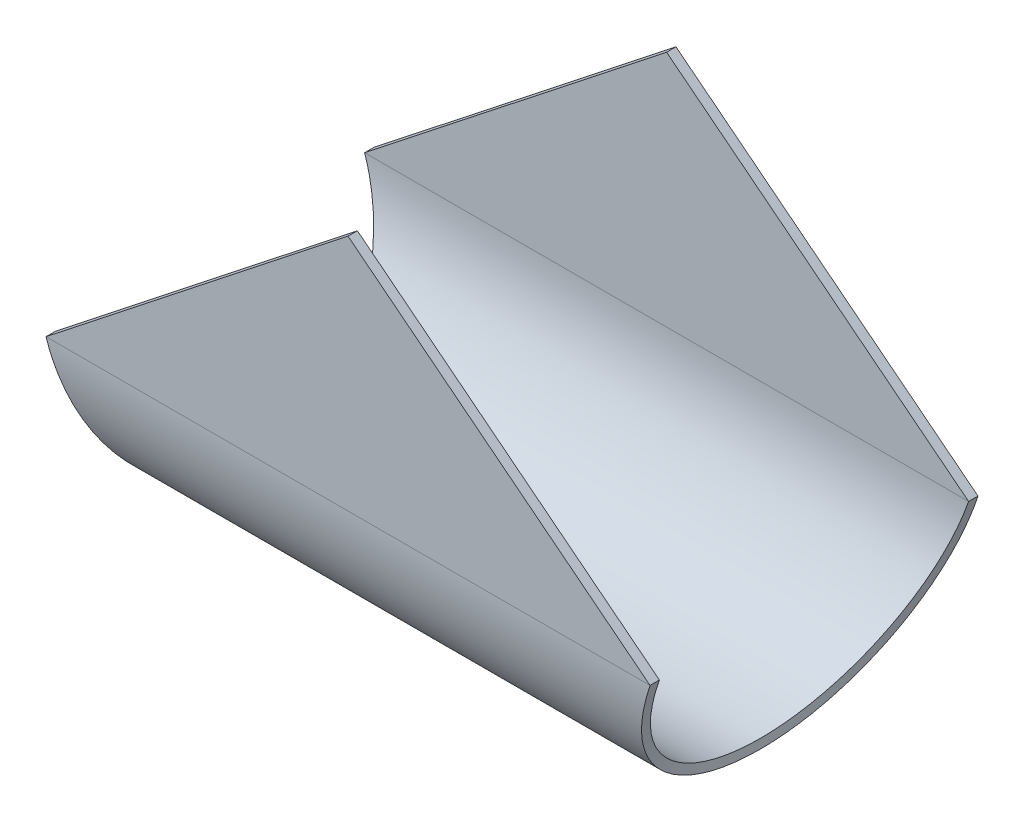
ISO-10303-21;
HEADER;
FILE_DESCRIPTION(('STEP AP214'),'2;1');
FILE_NAME('part.step','',(''),(''),'','','');
FILE_SCHEMA(('AUTOMOTIVE_DESIGN { 1 0 10303 214 1 1 1 1 }'));
ENDSEC;
DATA;
#1=APPLICATION_CONTEXT('core data for automotive mechanical design processes');
#2=APPLICATION_PROTOCOL_DEFINITION('international standard','automotive_design',2000,#1);
#3=PRODUCT_CONTEXT('',#1,'mechanical');
#4=PRODUCT('Part','Part','',(#3));
#5=PRODUCT_RELATED_PRODUCT_CATEGORY('part','',(#4));
#6=PRODUCT_DEFINITION_FORMATION('','',#4);
#7=PRODUCT_DEFINITION_CONTEXT('part definition',#1,'design');
#8=PRODUCT_DEFINITION('design','',#6,#7);
#9=PRODUCT_DEFINITION_SHAPE('','',#8);
#10=(LENGTH_UNIT() NAMED_UNIT(*) SI_UNIT(.MILLI.,.METRE.));
#11=(NAMED_UNIT(*) PLANE_ANGLE_UNIT() SI_UNIT($,.RADIAN.));
#12=(NAMED_UNIT(*) SI_UNIT($,.STERADIAN.) SOLID_ANGLE_UNIT());
#13=UNCERTAINTY_MEASURE_WITH_UNIT(LENGTH_MEASURE(1.E-05),#10,'distance_accuracy_value','');
#14=(GEOMETRIC_REPRESENTATION_CONTEXT(3) GLOBAL_UNCERTAINTY_ASSIGNED_CONTEXT((#13)) GLOBAL_UNIT_ASSIGNED_CONTEXT((#10,
#11,#12)) REPRESENTATION_CONTEXT('',''));
#15=CARTESIAN_POINT('',(0.,0.,0.));
#16=DIRECTION('',(0.,0.,1.));
#17=DIRECTION('',(1.,0.,0.));
#18=AXIS2_PLACEMENT_3D('',#15,#16,#17);
#19=CARTESIAN_POINT('',(0.,0.,17.4844566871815));
#20=DIRECTION('',(0.,0.,1.));
#21=DIRECTION('',(1.,0.,0.));
#22=AXIS2_PLACEMENT_3D('',#19,#20,#21);
#23=PLANE('',#22);
#24=DIRECTION('',(-0.785370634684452,0.619025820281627,0.));
#25=VECTOR('',#24,1.);
#26=CARTESIAN_POINT('',(32.2001960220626,-25.3800586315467,17.4844566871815));
#27=LINE('',#26,#25);
#28=CARTESIAN_POINT('',(32.2001960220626,-25.3800586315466,17.4844566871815));
#29=VERTEX_POINT('',#28);
#30=CARTESIAN_POINT('',(0.,0.,17.4844566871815));
#31=VERTEX_POINT('',#30);
#32=EDGE_CURVE('E55',#29,#31,#27,.T.);
#33=ORIENTED_EDGE('',*,*,#32,.T.);
#34=DIRECTION('',(-0.785370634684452,-0.619025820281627,0.));
#35=VECTOR('',#34,1.);
#36=CARTESIAN_POINT('',(0.,0.,17.4844566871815));
#37=LINE('',#36,#35);
#38=CARTESIAN_POINT('',(-32.2001960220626,-25.3800586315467,17.4844566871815));
#39=VERTEX_POINT('',#38);
#40=EDGE_CURVE('E94',#31,#39,#37,.T.);
#41=ORIENTED_EDGE('',*,*,#40,.T.);
#42=DIRECTION('',(-1.,0.,0.));
#43=VECTOR('',#42,1.);
#44=CARTESIAN_POINT('',(-32.2001960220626,-25.3800586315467,17.4844566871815));
#45=LINE('',#44,#43);
#46=EDGE_CURVE('E106',#29,#39,#45,.T.);
#47=ORIENTED_EDGE('',*,*,#46,.F.);
#48=EDGE_LOOP('',(#33,#41,#47));
#49=FACE_BOUND('',#48,.T.);
#50=ADVANCED_FACE('F37',(#49),#23,.T.);
#51=CARTESIAN_POINT('',(32.2001960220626,-25.3800586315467,-121.957702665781));
#52=DIRECTION('',(0.619025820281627,0.785370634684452,0.));
#53=DIRECTION('',(0.785370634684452,-0.619025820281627,0.));
#54=AXIS2_PLACEMENT_3D('',#51,#52,#53);
#55=PLANE('',#54);
#56=DIRECTION('',(0.,0.,1.));
#57=VECTOR('',#56,1.);
#58=CARTESIAN_POINT('',(0.,0.,-121.957702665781));
#59=LINE('',#58,#57);
#60=CARTESIAN_POINT('',(0.,0.,16.4844566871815));
#61=VERTEX_POINT('',#60);
#62=EDGE_CURVE('E103',#61,#31,#59,.T.);
#63=ORIENTED_EDGE('',*,*,#62,.T.);
#64=ORIENTED_EDGE('',*,*,#32,.F.);
#65=CARTESIAN_POINT('',(32.2001960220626,-25.3800586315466,16.4844566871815));
#66=CARTESIAN_POINT('',(32.2001960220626,-25.3800586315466,17.4844566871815));
#67=B_SPLINE_CURVE_WITH_KNOTS('',1,(#65,#66),.UNSPECIFIED.,.F.,.F.,(2,2),(0.,1.),.UNSPECIFIED.);
#68=CARTESIAN_POINT('',(32.2001960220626,-25.3800586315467,16.4844566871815));
#69=VERTEX_POINT('',#68);
#70=EDGE_CURVE('E13',#69,#29,#67,.T.);
#71=ORIENTED_EDGE('',*,*,#70,.F.);
#72=DIRECTION('',(-0.785370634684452,0.619025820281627,0.));
#73=VECTOR('',#72,1.);
#74=CARTESIAN_POINT('',(32.2001960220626,-25.3800586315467,16.4844566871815));
#75=LINE('',#74,#73);
#76=EDGE_CURVE('E118',#69,#61,#75,.T.);
#77=ORIENTED_EDGE('',*,*,#76,.T.);
#78=EDGE_LOOP('',(#63,#64,#71,#77));
#79=FACE_BOUND('',#78,.T.);
#80=ADVANCED_FACE('F39',(#79),#55,.T.);
#81=CARTESIAN_POINT('',(0.,0.,-121.957702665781));
#82=DIRECTION('',(-0.619025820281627,0.785370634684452,0.));
#83=DIRECTION('',(0.785370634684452,0.619025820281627,0.));
#84=AXIS2_PLACEMENT_3D('',#81,#82,#83);
#85=PLANE('',#84);
#86=CARTESIAN_POINT('',(-32.2001960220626,-25.3800586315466,17.4844566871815));
#87=CARTESIAN_POINT('',(-32.2001960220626,-25.3800586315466,16.4844566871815));
#88=B_SPLINE_CURVE_WITH_KNOTS('',1,(#86,#87),.UNSPECIFIED.,.F.,.F.,(2,2),(0.,1.),.UNSPECIFIED.);
#89=CARTESIAN_POINT('',(-32.2001960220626,-25.3800586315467,16.4844566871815));
#90=VERTEX_POINT('',#89);
#91=EDGE_CURVE('E48',#90,#39,#88,.F.);
#92=ORIENTED_EDGE('',*,*,#91,.T.);
#93=ORIENTED_EDGE('',*,*,#40,.F.);
#94=ORIENTED_EDGE('',*,*,#62,.F.);
#95=DIRECTION('',(-0.785370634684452,-0.619025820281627,0.));
#96=VECTOR('',#95,1.);
#97=CARTESIAN_POINT('',(0.,0.,16.4844566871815));
#98=LINE('',#97,#96);
#99=EDGE_CURVE('E97',#61,#90,#98,.T.);
#100=ORIENTED_EDGE('',*,*,#99,.T.);
#101=EDGE_LOOP('',(#92,#93,#94,#100));
#102=FACE_BOUND('',#101,.T.);
#103=ADVANCED_FACE('F93',(#102),#85,.T.);
#104=CARTESIAN_POINT('',(0.,0.,16.4844566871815));
#105=DIRECTION('',(0.,0.,1.));
#106=DIRECTION('',(1.,0.,0.));
#107=AXIS2_PLACEMENT_3D('',#104,#105,#106);
#108=PLANE('',#107);
#109=ORIENTED_EDGE('',*,*,#76,.F.);
#110=DIRECTION('',(1.,0.,0.));
#111=VECTOR('',#110,1.);
#112=CARTESIAN_POINT('',(-32.2001960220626,-25.3800586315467,16.4844566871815));
#113=LINE('',#112,#111);
#114=EDGE_CURVE('E281',#69,#90,#113,.F.);
#115=ORIENTED_EDGE('',*,*,#114,.T.);
#116=ORIENTED_EDGE('',*,*,#99,.F.);
#117=EDGE_LOOP('',(#109,#115,#116));
#118=FACE_BOUND('',#117,.T.);
#119=ADVANCED_FACE('F290',(#118),#108,.F.);
#120=CARTESIAN_POINT('',(0.,0.,-16.4844566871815));
#121=DIRECTION('',(0.,0.,-1.));
#122=DIRECTION('',(1.,0.,0.));
#123=AXIS2_PLACEMENT_3D('',#120,#121,#122);
#124=PLANE('',#123);
#125=DIRECTION('',(-0.785370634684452,0.619025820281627,0.));
#126=VECTOR('',#125,1.);
#127=CARTESIAN_POINT('',(32.2001960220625,-25.3800586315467,-16.4844566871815));
#128=LINE('',#127,#126);
#129=CARTESIAN_POINT('',(32.2001960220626,-25.3800586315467,-16.4844566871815));
#130=VERTEX_POINT('',#129);
#131=CARTESIAN_POINT('',(0.,0.,-16.4844566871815));
#132=VERTEX_POINT('',#131);
#133=EDGE_CURVE('E362',#130,#132,#128,.T.);
#134=ORIENTED_EDGE('',*,*,#133,.T.);
#135=DIRECTION('',(-0.785370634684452,-0.619025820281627,0.));
#136=VECTOR('',#135,1.);
#137=CARTESIAN_POINT('',(0.,0.,-16.4844566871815));
#138=LINE('',#137,#136);
#139=CARTESIAN_POINT('',(-32.2001960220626,-25.3800586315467,-16.4844566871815));
#140=VERTEX_POINT('',#139);
#141=EDGE_CURVE('E364',#132,#140,#138,.T.);
#142=ORIENTED_EDGE('',*,*,#141,.T.);
#143=DIRECTION('',(1.,0.,0.));
#144=VECTOR('',#143,1.);
#145=CARTESIAN_POINT('',(-32.2001960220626,-25.3800586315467,-16.4844566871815));
#146=LINE('',#145,#144);
#147=EDGE_CURVE('E213',#140,#130,#146,.T.);
#148=ORIENTED_EDGE('',*,*,#147,.T.);
#149=EDGE_LOOP('',(#134,#142,#148));
#150=FACE_BOUND('',#149,.T.);
#151=ADVANCED_FACE('F239',(#150),#124,.F.);
#152=CARTESIAN_POINT('',(32.2001960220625,-25.3800586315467,121.957702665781));
#153=DIRECTION('',(-0.619025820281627,-0.785370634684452,0.));
#154=DIRECTION('',(0.785370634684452,-0.619025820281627,0.));
#155=AXIS2_PLACEMENT_3D('',#152,#153,#154);
#156=PLANE('',#155);
#157=DIRECTION('',(-0.785370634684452,0.619025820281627,0.));
#158=VECTOR('',#157,1.);
#159=CARTESIAN_POINT('',(32.2001960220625,-25.3800586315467,-17.4844566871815));
#160=LINE('',#159,#158);
#161=CARTESIAN_POINT('',(32.2001960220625,-25.3800586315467,-17.4844566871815));
#162=VERTEX_POINT('',#161);
#163=CARTESIAN_POINT('',(0.,0.,-17.4844566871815));
#164=VERTEX_POINT('',#163);
#165=EDGE_CURVE('E211',#162,#164,#160,.T.);
#166=ORIENTED_EDGE('',*,*,#165,.T.);
#167=DIRECTION('',(0.,0.,-1.));
#168=VECTOR('',#167,1.);
#169=CARTESIAN_POINT('',(0.,0.,121.957702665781));
#170=LINE('',#169,#168);
#171=EDGE_CURVE('E202',#132,#164,#170,.T.);
#172=ORIENTED_EDGE('',*,*,#171,.F.);
#173=ORIENTED_EDGE('',*,*,#133,.F.);
#174=CARTESIAN_POINT('',(32.2001960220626,-25.3800586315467,-17.4844566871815));
#175=CARTESIAN_POINT('',(32.2001960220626,-25.3800586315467,-16.4844566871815));
#176=B_SPLINE_CURVE_WITH_KNOTS('',1,(#174,#175),.UNSPECIFIED.,.F.,.F.,(2,2),(0.,1.),.UNSPECIFIED.);
#177=EDGE_CURVE('E190',#130,#162,#176,.F.);
#178=ORIENTED_EDGE('',*,*,#177,.T.);
#179=EDGE_LOOP('',(#166,#172,#173,#178));
#180=FACE_BOUND('',#179,.T.);
#181=ADVANCED_FACE('F229',(#180),#156,.F.);
#182=CARTESIAN_POINT('',(0.,0.,-17.4844566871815));
#183=DIRECTION('',(0.,0.,-1.));
#184=DIRECTION('',(1.,0.,0.));
#185=AXIS2_PLACEMENT_3D('',#182,#183,#184);
#186=PLANE('',#185);
#187=ORIENTED_EDGE('',*,*,#165,.F.);
#188=DIRECTION('',(-1.,0.,0.));
#189=VECTOR('',#188,1.);
#190=CARTESIAN_POINT('',(-32.2001960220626,-25.3800586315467,-17.4844566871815));
#191=LINE('',#190,#189);
#192=CARTESIAN_POINT('',(-32.2001960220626,-25.3800586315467,-17.4844566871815));
#193=VERTEX_POINT('',#192);
#194=EDGE_CURVE('E216',#162,#193,#191,.T.);
#195=ORIENTED_EDGE('',*,*,#194,.T.);
#196=DIRECTION('',(-0.785370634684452,-0.619025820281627,0.));
#197=VECTOR('',#196,1.);
#198=CARTESIAN_POINT('',(0.,0.,-17.4844566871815));
#199=LINE('',#198,#197);
#200=EDGE_CURVE('E210',#164,#193,#199,.T.);
#201=ORIENTED_EDGE('',*,*,#200,.F.);
#202=EDGE_LOOP('',(#187,#195,#201));
#203=FACE_BOUND('',#202,.T.);
#204=ADVANCED_FACE('F238',(#203),#186,.T.);
#205=CARTESIAN_POINT('',(0.,0.,121.957702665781));
#206=DIRECTION('',(0.619025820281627,-0.785370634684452,0.));
#207=DIRECTION('',(0.785370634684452,0.619025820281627,0.));
#208=AXIS2_PLACEMENT_3D('',#205,#206,#207);
#209=PLANE('',#208);
#210=ORIENTED_EDGE('',*,*,#200,.T.);
#211=CARTESIAN_POINT('',(-32.2001960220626,-25.3800586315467,-16.4844566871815));
#212=CARTESIAN_POINT('',(-32.2001960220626,-25.3800586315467,-17.4844566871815));
#213=B_SPLINE_CURVE_WITH_KNOTS('',1,(#211,#212),.UNSPECIFIED.,.F.,.F.,(2,2),(0.,1.),.UNSPECIFIED.);
#214=EDGE_CURVE('E123',#140,#193,#213,.T.);
#215=ORIENTED_EDGE('',*,*,#214,.F.);
#216=ORIENTED_EDGE('',*,*,#141,.F.);
#217=ORIENTED_EDGE('',*,*,#171,.T.);
#218=EDGE_LOOP('',(#210,#215,#216,#217));
#219=FACE_BOUND('',#218,.T.);
#220=ADVANCED_FACE('F242',(#219),#209,.F.);
#221=CARTESIAN_POINT('',(32.2001960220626,-25.3800586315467,-17.4844566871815));
#222=CARTESIAN_POINT('',(31.9574017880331,-26.1228092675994,-17.4844566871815));
#223=CARTESIAN_POINT('',(31.7456337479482,-26.7717538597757,-17.4378750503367));
#224=CARTESIAN_POINT('',(31.4742512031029,-27.6018365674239,-17.3449545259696));
#225=CARTESIAN_POINT('',(31.3915169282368,-27.8547027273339,-17.3100023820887));
#226=CARTESIAN_POINT('',(31.279005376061,-28.1985043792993,-17.2561885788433));
#227=CARTESIAN_POINT('',(31.2434331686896,-28.3071918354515,-17.2380107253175));
#228=CARTESIAN_POINT('',(31.1929723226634,-28.4614052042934,-17.2108760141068));
#229=CARTESIAN_POINT('',(31.1766349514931,-28.5113401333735,-17.2018525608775));
#230=CARTESIAN_POINT('',(31.1528532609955,-28.5840454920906,-17.188406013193));
#231=CARTESIAN_POINT('',(31.1450467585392,-28.6079144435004,-17.1839385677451));
#232=CARTESIAN_POINT('',(31.1335180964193,-28.6431695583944,-17.1772662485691));
#233=CARTESIAN_POINT('',(31.1297053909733,-28.6548298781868,-17.1750469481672));
#234=CARTESIAN_POINT('',(31.1240316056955,-28.6721833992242,-17.1717260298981));
#235=CARTESIAN_POINT('',(31.1221478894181,-28.677945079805,-17.1706203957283));
#236=CARTESIAN_POINT('',(31.1193336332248,-28.6865533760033,-17.1689640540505));
#237=CARTESIAN_POINT('',(31.1183974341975,-28.6894171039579,-17.1684122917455));
#238=CARTESIAN_POINT('',(31.1169959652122,-28.6937041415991,-17.1675851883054));
#239=CARTESIAN_POINT('',(31.1165292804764,-28.6951317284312,-17.1673095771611));
#240=CARTESIAN_POINT('',(31.11559685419,-28.6979840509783,-17.1667585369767));
#241=CARTESIAN_POINT('',(31.115436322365,-28.6984751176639,-17.1666637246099));
#242=CARTESIAN_POINT('',(30.9174230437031,-29.3042188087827,-17.0494836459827));
#243=CARTESIAN_POINT('',(30.7313121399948,-29.8740297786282,-16.9062978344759));
#244=CARTESIAN_POINT('',(30.4688436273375,-30.6770619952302,-16.6651161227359));
#245=CARTESIAN_POINT('',(30.3841370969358,-30.9361497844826,-16.5803080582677));
#246=CARTESIAN_POINT('',(30.2612517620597,-31.3119253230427,-16.4480034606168));
#247=CARTESIAN_POINT('',(30.220985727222,-31.4350423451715,-16.4030522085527));
#248=CARTESIAN_POINT('',(30.1616302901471,-31.6165191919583,-16.3345329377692));
#249=CARTESIAN_POINT('',(30.142019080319,-31.6764784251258,-16.3115110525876));
#250=CARTESIAN_POINT('',(30.1128631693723,-31.7656199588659,-16.2767272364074));
#251=CARTESIAN_POINT('',(30.103188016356,-31.7952009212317,-16.265090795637));
#252=CARTESIAN_POINT('',(30.0887405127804,-31.839373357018,-16.2475761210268));
#253=CARTESIAN_POINT('',(30.0839355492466,-31.8540643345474,-16.2417278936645));
#254=CARTESIAN_POINT('',(30.0767444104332,-31.8760510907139,-16.2329408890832));
#255=CARTESIAN_POINT('',(30.0743500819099,-31.8833717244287,-16.2300094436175));
#256=CARTESIAN_POINT('',(30.0707626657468,-31.8943402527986,-16.2256086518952));
#257=CARTESIAN_POINT('',(30.0695675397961,-31.8979943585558,-16.2241411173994));
#258=CARTESIAN_POINT('',(30.0671786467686,-31.9052984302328,-16.221204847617));
#259=CARTESIAN_POINT('',(30.066228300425,-31.9082041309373,-16.2200358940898));
#260=CARTESIAN_POINT('',(29.6970456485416,-33.0369896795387,-15.7653736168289));
#261=CARTESIAN_POINT('',(29.3647163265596,-34.0544441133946,-15.2197180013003));
#262=CARTESIAN_POINT('',(28.9935757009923,-35.1895093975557,-14.4759994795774));
#263=CARTESIAN_POINT('',(28.9215611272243,-35.4097475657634,-14.3241402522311));
#264=CARTESIAN_POINT('',(28.8343098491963,-35.6766727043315,-14.131181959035));
#265=CARTESIAN_POINT('',(28.8169979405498,-35.7296392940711,-14.0924334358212));
#266=CARTESIAN_POINT('',(28.7955309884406,-35.7953264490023,-14.043813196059));
#267=CARTESIAN_POINT('',(28.7912462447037,-35.8084378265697,-14.0340799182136));
#268=CARTESIAN_POINT('',(28.7826940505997,-35.8346085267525,-14.0145951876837));
#269=CARTESIAN_POINT('',(28.7779163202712,-35.8492294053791,-14.0036788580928));
#270=CARTESIAN_POINT('',(28.7636079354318,-35.8930156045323,-13.9708729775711));
#271=CARTESIAN_POINT('',(28.7541024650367,-35.9221039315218,-13.9489365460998));
#272=CARTESIAN_POINT('',(28.706742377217,-36.0670327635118,-13.8389304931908));
#273=CARTESIAN_POINT('',(28.6693895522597,-36.1813346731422,-13.7498892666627));
#274=CARTESIAN_POINT('',(28.5589368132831,-36.5193045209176,-13.4798590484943));
#275=CARTESIAN_POINT('',(28.4874426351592,-36.7380343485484,-13.2959646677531));
#276=CARTESIAN_POINT('',(28.3834128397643,-37.0562459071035,-13.0151024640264));
#277=CARTESIAN_POINT('',(28.3492714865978,-37.1606697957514,-12.920644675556));
#278=CARTESIAN_POINT('',(28.2988623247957,-37.3148395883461,-12.7777986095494));
#279=CARTESIAN_POINT('',(28.2821930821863,-37.3658185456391,-12.7299900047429));
#280=CARTESIAN_POINT('',(28.2573899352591,-37.441671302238,-12.6579990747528));
#281=CARTESIAN_POINT('',(28.2491556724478,-37.4668529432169,-12.6339557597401));
#282=CARTESIAN_POINT('',(28.2368544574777,-37.5044716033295,-12.5978227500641));
#283=CARTESIAN_POINT('',(28.2327624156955,-37.5169855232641,-12.585767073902));
#284=CARTESIAN_POINT('',(28.2266368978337,-37.5357179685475,-12.5676667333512));
#285=CARTESIAN_POINT('',(28.2245971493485,-37.5419557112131,-12.5616304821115));
#286=CARTESIAN_POINT('',(28.2205218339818,-37.5544183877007,-12.549552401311));
#287=CARTESIAN_POINT('',(28.2186634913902,-37.5601013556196,-12.5440373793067));
#288=CARTESIAN_POINT('',(27.9334831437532,-38.4322054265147,-11.6963253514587));
#289=CARTESIAN_POINT('',(27.6858392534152,-39.1915298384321,-10.7835586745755));
#290=CARTESIAN_POINT('',(27.3673620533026,-40.1659294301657,-9.34976805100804));
#291=CARTESIAN_POINT('',(27.2700344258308,-40.4634144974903,-8.86103363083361));
#292=CARTESIAN_POINT('',(27.1372901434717,-40.8689282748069,-8.11670941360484));
#293=CARTESIAN_POINT('',(27.0952499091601,-40.9973200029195,-7.86672789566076));
#294=CARTESIAN_POINT('',(27.0355013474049,-41.1798224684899,-7.48953917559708));
#295=CARTESIAN_POINT('',(27.0161371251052,-41.2389761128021,-7.36343998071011));
#296=CARTESIAN_POINT('',(26.9879187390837,-41.3251993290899,-7.17380898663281));
#297=CARTESIAN_POINT('',(26.9786506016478,-41.3535225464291,-7.11051827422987));
#298=CARTESIAN_POINT('',(26.9649553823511,-41.3953824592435,-7.01547053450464));
#299=CARTESIAN_POINT('',(26.9604248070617,-41.4092316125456,-6.98376934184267));
#300=CARTESIAN_POINT('',(26.9536806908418,-41.4298493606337,-6.9361907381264));
#301=CARTESIAN_POINT('',(26.9514412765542,-41.4366959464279,-6.92032673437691));
#302=CARTESIAN_POINT('',(26.9480950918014,-41.4469268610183,-6.89652416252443));
#303=CARTESIAN_POINT('',(26.9469818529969,-41.4503306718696,-6.88858887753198));
#304=CARTESIAN_POINT('',(26.9447596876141,-41.4571253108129,-6.87271614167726));
#305=CARTESIAN_POINT('',(26.9437363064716,-41.4602545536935,-6.8653922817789));
#306=CARTESIAN_POINT('',(26.7899275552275,-41.9305788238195,-5.76216966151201));
#307=CARTESIAN_POINT('',(26.675464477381,-42.2819901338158,-4.62709035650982));
#308=CARTESIAN_POINT('',(26.5228450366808,-42.7489406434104,-2.32533682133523));
#309=CARTESIAN_POINT('',(26.4846886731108,-42.8645096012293,-1.15845391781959));
#310=CARTESIAN_POINT('',(26.4846826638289,-42.8645210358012,1.15828132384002));
#311=CARTESIAN_POINT('',(26.5228342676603,-42.7490186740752,2.32475488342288));
#312=CARTESIAN_POINT('',(26.6372935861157,-42.3988628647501,4.05108457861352));
#313=CARTESIAN_POINT('',(26.6849853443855,-42.2527344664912,4.62260682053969));
#314=CARTESIAN_POINT('',(26.7708309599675,-41.9896684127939,5.46941066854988));
#315=CARTESIAN_POINT('',(26.8018308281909,-41.8946724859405,5.74993129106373));
#316=CARTESIAN_POINT('',(26.8519076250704,-41.741293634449,6.16751194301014));
#317=CARTESIAN_POINT('',(26.8691960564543,-41.6883535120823,6.30617209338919));
#318=CARTESIAN_POINT('',(26.8960229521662,-41.6062349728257,6.51328969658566));
#319=CARTESIAN_POINT('',(26.9051142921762,-41.578410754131,6.58218346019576));
#320=CARTESIAN_POINT('',(26.9189748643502,-41.535999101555,6.68529688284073));
#321=CARTESIAN_POINT('',(26.9236323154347,-41.5217493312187,6.71963015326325));
#322=CARTESIAN_POINT('',(26.9306743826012,-41.5002060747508,6.77107211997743));
#323=CARTESIAN_POINT('',(26.9330310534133,-41.492996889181,6.78820978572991));
#324=CARTESIAN_POINT('',(26.9365800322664,-41.4821409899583,6.81390165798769));
#325=CARTESIAN_POINT('',(26.93776535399,-41.4785153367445,6.82246317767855));
#326=CARTESIAN_POINT('',(26.940140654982,-41.471249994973,6.83958131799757));
#327=CARTESIAN_POINT('',(26.9414167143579,-41.4673470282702,6.84875551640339));
#328=CARTESIAN_POINT('',(27.0841201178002,-41.0308851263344,7.87257453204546));
#329=CARTESIAN_POINT('',(27.2610773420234,-40.4910188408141,8.87134529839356));
#330=CARTESIAN_POINT('',(27.57955325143,-39.516661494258,10.3051734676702));
#331=CARTESIAN_POINT('',(27.6945519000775,-39.1645375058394,10.7723390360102));
#332=CARTESIAN_POINT('',(27.8803098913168,-38.5956881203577,11.4516633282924));
#333=CARTESIAN_POINT('',(27.9444392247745,-38.3993011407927,11.6745315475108));
#334=CARTESIAN_POINT('',(28.0439482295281,-38.094671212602,12.0027970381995));
#335=CARTESIAN_POINT('',(28.0776703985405,-37.991453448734,12.1112126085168));
#336=CARTESIAN_POINT('',(28.1290824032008,-37.8341325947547,12.2722409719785));
#337=CARTESIAN_POINT('',(28.1463578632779,-37.7812766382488,12.325651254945));
#338=CARTESIAN_POINT('',(28.1724782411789,-37.7013716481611,12.405357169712));
#339=CARTESIAN_POINT('',(28.1812195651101,-37.6746331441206,12.4318575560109));
#340=CARTESIAN_POINT('',(28.1943833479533,-37.6343704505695,12.471504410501));
#341=CARTESIAN_POINT('',(28.1987799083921,-37.6209237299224,12.4847027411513));
#342=CARTESIAN_POINT('',(28.2053876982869,-37.6007149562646,12.5044741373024));
#343=CARTESIAN_POINT('',(28.2075924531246,-37.5939722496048,12.5110602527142));
#344=CARTESIAN_POINT('',(28.2120062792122,-37.5804739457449,12.5242237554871));
#345=CARTESIAN_POINT('',(28.2143934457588,-37.573173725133,12.5313305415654));
#346=CARTESIAN_POINT('',(28.3465471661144,-37.1690417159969,12.9241652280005));
#347=CARTESIAN_POINT('',(28.4852463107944,-36.7448125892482,13.2996741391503));
#348=CARTESIAN_POINT('',(28.6693434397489,-36.1814962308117,13.7497624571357));
#349=CARTESIAN_POINT('',(28.7066990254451,-36.067184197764,13.8388137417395));
#350=CARTESIAN_POINT('',(28.7540637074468,-35.9222381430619,13.9488351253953));
#351=CARTESIAN_POINT('',(28.7635701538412,-35.8931461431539,13.9707747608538));
#352=CARTESIAN_POINT('',(28.7778800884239,-35.8493540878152,14.0035856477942));
#353=CARTESIAN_POINT('',(28.7826583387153,-35.8347312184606,14.0145036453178));
#354=CARTESIAN_POINT('',(28.7912028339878,-35.8085834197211,14.0339717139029));
#355=CARTESIAN_POINT('',(28.7954837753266,-35.7954833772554,14.0436967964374));
#356=CARTESIAN_POINT('',(28.8169319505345,-35.7298523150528,14.0922767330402));
#357=CARTESIAN_POINT('',(28.8342295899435,-35.6769287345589,14.1309951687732));
#358=CARTESIAN_POINT('',(28.921413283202,-35.4102090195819,14.323813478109));
#359=CARTESIAN_POINT('',(28.9933858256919,-35.1901043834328,14.4755942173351));
#360=CARTESIAN_POINT('',(29.215980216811,-34.5093622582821,14.9216768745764));
#361=CARTESIAN_POINT('',(29.3732788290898,-34.0282486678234,15.2067478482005));
#362=CARTESIAN_POINT('',(29.6225802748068,-33.2654656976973,15.6079824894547));
#363=CARTESIAN_POINT('',(29.7079063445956,-33.0043640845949,15.7373246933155));
#364=CARTESIAN_POINT('',(29.8392338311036,-32.6025411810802,15.9236858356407));
#365=CARTESIAN_POINT('',(29.8835660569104,-32.4669059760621,15.9845304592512));
#366=CARTESIAN_POINT('',(29.9508989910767,-32.2609310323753,16.0737493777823));
#367=CARTESIAN_POINT('',(29.9734824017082,-32.19185241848,16.1031476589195));
#368=CARTESIAN_POINT('',(30.0075661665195,-32.0876069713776,16.1467160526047));
#369=CARTESIAN_POINT('',(30.0189621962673,-32.0527539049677,16.1611506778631));
#370=CARTESIAN_POINT('',(30.0361084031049,-32.0003178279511,16.1826682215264));
#371=CARTESIAN_POINT('',(30.0418324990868,-31.9828130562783,16.1898183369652));
#372=CARTESIAN_POINT('',(30.0504316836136,-31.9565168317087,16.2005096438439));
#373=CARTESIAN_POINT('',(30.0533002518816,-31.9477449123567,16.2040677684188));
#374=CARTESIAN_POINT('',(30.057606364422,-31.9345772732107,16.2093964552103));
#375=CARTESIAN_POINT('',(30.0590422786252,-31.9301864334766,16.2111712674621));
#376=CARTESIAN_POINT('',(30.0619151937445,-31.9214015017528,16.2147180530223));
#377=CARTESIAN_POINT('',(30.0635966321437,-31.9162599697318,16.2167910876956));
#378=CARTESIAN_POINT('',(30.2175074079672,-31.4456321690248,16.4063552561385));
#379=CARTESIAN_POINT('',(30.3813555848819,-30.9446792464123,16.5847424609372));
#380=CARTESIAN_POINT('',(30.643823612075,-30.1416436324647,16.8259219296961));
#381=CARTESIAN_POINT('',(30.7340955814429,-29.8653807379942,16.901898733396));
#382=CARTESIAN_POINT('',(30.8736774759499,-29.4382049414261,17.0076215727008));
#383=CARTESIAN_POINT('',(30.9209004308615,-29.2936841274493,17.041487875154));
#384=CARTESIAN_POINT('',(30.9927783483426,-29.0737345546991,17.0900152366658));
#385=CARTESIAN_POINT('',(31.0169115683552,-28.9998900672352,17.1058122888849));
#386=CARTESIAN_POINT('',(31.0533722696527,-28.8883353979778,17.1289130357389));
#387=CARTESIAN_POINT('',(31.0655693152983,-28.8510191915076,17.1365141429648));
#388=CARTESIAN_POINT('',(31.0839301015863,-28.7948484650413,17.1477637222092));
#389=CARTESIAN_POINT('',(31.0900612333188,-28.7760921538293,17.1514882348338));
#390=CARTESIAN_POINT('',(31.0992742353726,-28.7479086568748,17.1570365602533));
#391=CARTESIAN_POINT('',(31.1023479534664,-28.7385059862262,17.1588795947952));
#392=CARTESIAN_POINT('',(31.1069626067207,-28.7243897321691,17.1616344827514));
#393=CARTESIAN_POINT('',(31.1085015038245,-28.7196822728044,17.1625511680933));
#394=CARTESIAN_POINT('',(31.1108108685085,-28.7126180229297,17.1639237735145));
#395=CARTESIAN_POINT('',(31.1115808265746,-28.7102627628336,17.1643809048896));
#396=CARTESIAN_POINT('',(31.1131210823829,-28.7055512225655,17.1652943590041));
#397=CARTESIAN_POINT('',(31.1141951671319,-28.702265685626,17.1659304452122));
#398=CARTESIAN_POINT('',(31.2341320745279,-28.3353896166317,17.2369021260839));
#399=CARTESIAN_POINT('',(31.3843283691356,-27.8769007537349,17.3142161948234));
#400=CARTESIAN_POINT('',(31.7461730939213,-26.7701101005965,17.4380061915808));
#401=CARTESIAN_POINT('',(31.9577620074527,-26.1217088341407,17.4844566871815));
#402=CARTESIAN_POINT('',(32.2001960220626,-25.3800586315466,17.4844566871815));
#403=CARTESIAN_POINT('',(32.2001960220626,-25.3800586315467,-16.4844566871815));
#404=CARTESIAN_POINT('',(31.9574025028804,-26.0803265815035,-16.4844566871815));
#405=CARTESIAN_POINT('',(31.7456337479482,-26.6921577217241,-16.4405392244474));
#406=CARTESIAN_POINT('',(31.4742512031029,-27.4747649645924,-16.3529331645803));
#407=CARTESIAN_POINT('',(31.3915169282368,-27.7131687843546,-16.3199800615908));
#408=CARTESIAN_POINT('',(31.279005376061,-28.0373071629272,-16.2692440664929));
#409=CARTESIAN_POINT('',(31.2434331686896,-28.1397783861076,-16.2521058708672));
#410=CARTESIAN_POINT('',(31.1929723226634,-28.2851717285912,-16.2265230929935));
#411=CARTESIAN_POINT('',(31.1766349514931,-28.3322506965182,-16.2180157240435));
#412=CARTESIAN_POINT('',(31.1528532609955,-28.4007977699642,-16.2053382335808));
#413=CARTESIAN_POINT('',(31.1450467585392,-28.4233015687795,-16.2011262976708));
#414=CARTESIAN_POINT('',(31.1335180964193,-28.4565403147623,-16.1948355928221));
#415=CARTESIAN_POINT('',(31.1297053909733,-28.4675337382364,-16.1927432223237));
#416=CARTESIAN_POINT('',(31.1240316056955,-28.4838947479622,-16.1896122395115));
#417=CARTESIAN_POINT('',(31.1221478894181,-28.4893268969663,-16.188569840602));
#418=CARTESIAN_POINT('',(31.1193336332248,-28.4974428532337,-16.1870082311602));
#419=CARTESIAN_POINT('',(31.1183974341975,-28.5001427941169,-16.1864880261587));
#420=CARTESIAN_POINT('',(31.1169959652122,-28.5041846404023,-16.1857082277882));
#421=CARTESIAN_POINT('',(31.1165292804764,-28.5055305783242,-16.1854483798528));
#422=CARTESIAN_POINT('',(31.11559685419,-28.508219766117,-16.1849288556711));
#423=CARTESIAN_POINT('',(31.115436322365,-28.5086827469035,-16.1848394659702));
#424=CARTESIAN_POINT('',(30.9174230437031,-29.0797817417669,-16.0743613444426));
#425=CARTESIAN_POINT('',(30.7313121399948,-29.6170031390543,-15.9393648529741));
#426=CARTESIAN_POINT('',(30.4688436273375,-30.3741070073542,-15.7119772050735));
#427=CARTESIAN_POINT('',(30.3841370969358,-30.6183766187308,-15.632019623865));
#428=CARTESIAN_POINT('',(30.2612517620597,-30.9726601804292,-15.507282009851));
#429=CARTESIAN_POINT('',(30.220985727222,-31.0887356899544,-15.4649016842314));
#430=CARTESIAN_POINT('',(30.1616302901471,-31.2598332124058,-15.4003012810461));
#431=CARTESIAN_POINT('',(30.142019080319,-31.3163631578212,-15.3785961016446));
#432=CARTESIAN_POINT('',(30.1128631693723,-31.400406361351,-15.3458016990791));
#433=CARTESIAN_POINT('',(30.103188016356,-31.4282954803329,-15.3348307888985));
#434=CARTESIAN_POINT('',(30.0887405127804,-31.469941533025,-15.3183178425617));
#435=CARTESIAN_POINT('',(30.0839355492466,-31.4837922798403,-15.312804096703));
#436=CARTESIAN_POINT('',(30.0767444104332,-31.5045215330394,-15.3045196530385));
#437=CARTESIAN_POINT('',(30.0743500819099,-31.5114234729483,-15.3017558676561));
#438=CARTESIAN_POINT('',(30.0707626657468,-31.5217646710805,-15.2976067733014));
#439=CARTESIAN_POINT('',(30.0695675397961,-31.5252097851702,-15.2962231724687));
#440=CARTESIAN_POINT('',(30.0671786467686,-31.5320961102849,-15.29345483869));
#441=CARTESIAN_POINT('',(30.066228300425,-31.534835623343,-15.2923527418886));
#442=CARTESIAN_POINT('',(29.6970456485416,-32.5990617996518,-14.8636942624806));
#443=CARTESIAN_POINT('',(29.3647163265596,-33.5583242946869,-14.3492466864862));
#444=CARTESIAN_POINT('',(28.9935757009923,-34.6284710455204,-13.6480641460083));
#445=CARTESIAN_POINT('',(28.9215611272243,-34.8361129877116,-13.5048903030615));
#446=CARTESIAN_POINT('',(28.8343098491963,-35.0877717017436,-13.3229680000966));
#447=CARTESIAN_POINT('',(28.8169979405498,-35.1377089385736,-13.2864356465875));
#448=CARTESIAN_POINT('',(28.7955309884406,-35.1996392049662,-13.2405961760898));
#449=CARTESIAN_POINT('',(28.7912462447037,-35.2120006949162,-13.2314195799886));
#450=CARTESIAN_POINT('',(28.7826940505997,-35.2366745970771,-13.2130492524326));
#451=CARTESIAN_POINT('',(28.7779163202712,-35.2504592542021,-13.2027572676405));
#452=CARTESIAN_POINT('',(28.7636079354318,-35.2917411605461,-13.171827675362));
#453=CARTESIAN_POINT('',(28.7541024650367,-35.3191658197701,-13.1511458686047));
#454=CARTESIAN_POINT('',(28.706742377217,-35.455805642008,-13.0474314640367));
#455=CARTESIAN_POINT('',(28.6693895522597,-35.563570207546,-12.9634828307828));
#456=CARTESIAN_POINT('',(28.5589368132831,-35.8822103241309,-12.7088966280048));
#457=CARTESIAN_POINT('',(28.4874426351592,-36.0884301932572,-12.5355198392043));
#458=CARTESIAN_POINT('',(28.3834128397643,-36.3884420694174,-12.270721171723));
#459=CARTESIAN_POINT('',(28.3492714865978,-36.4868935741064,-12.1816657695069));
#460=CARTESIAN_POINT('',(28.2988623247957,-36.6322458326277,-12.0469895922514));
#461=CARTESIAN_POINT('',(28.2821930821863,-36.6803091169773,-12.001915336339));
#462=CARTESIAN_POINT('',(28.2573899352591,-36.7518235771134,-11.9340418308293));
#463=CARTESIAN_POINT('',(28.2491556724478,-36.7755649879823,-11.911373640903));
#464=CARTESIAN_POINT('',(28.2368544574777,-36.8110320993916,-11.8773072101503));
#465=CARTESIAN_POINT('',(28.2327624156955,-36.822830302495,-11.8659410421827));
#466=CARTESIAN_POINT('',(28.2266368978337,-36.840491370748,-11.8488759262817));
#467=CARTESIAN_POINT('',(28.2245971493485,-36.8463723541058,-11.8431849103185));
#468=CARTESIAN_POINT('',(28.2205218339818,-36.8581222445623,-11.8317976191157));
#469=CARTESIAN_POINT('',(28.2186634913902,-36.8634801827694,-11.8265980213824));
#470=CARTESIAN_POINT('',(27.9334831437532,-37.6857054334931,-11.0273697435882));
#471=CARTESIAN_POINT('',(27.6858392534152,-38.4016013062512,-10.1668075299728));
#472=CARTESIAN_POINT('',(27.3673620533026,-39.3202714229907,-8.81502063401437));
#473=CARTESIAN_POINT('',(27.2700344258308,-39.6007422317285,-8.35423872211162));
#474=CARTESIAN_POINT('',(27.1372901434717,-39.9830631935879,-7.6524851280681));
#475=CARTESIAN_POINT('',(27.0952499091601,-40.1041117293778,-7.41680096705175));
#476=CARTESIAN_POINT('',(27.0355013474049,-40.2761762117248,-7.06118504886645));
#477=CARTESIAN_POINT('',(27.0161371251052,-40.3319466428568,-6.9422979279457));
#478=CARTESIAN_POINT('',(26.9879187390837,-40.4132384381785,-6.76351262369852));
#479=CARTESIAN_POINT('',(26.9786506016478,-40.4399417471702,-6.70384173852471));
#480=CARTESIAN_POINT('',(26.9649553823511,-40.4794075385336,-6.61423012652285));
#481=CARTESIAN_POINT('',(26.9604248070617,-40.4924646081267,-6.58434204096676));
#482=CARTESIAN_POINT('',(26.9536806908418,-40.5119031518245,-6.53948463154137));
#483=CARTESIAN_POINT('',(26.9514412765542,-40.5183581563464,-6.5245279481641));
#484=CARTESIAN_POINT('',(26.9480950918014,-40.5280039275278,-6.50208673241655));
#485=CARTESIAN_POINT('',(26.9469818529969,-40.5312130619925,-6.49460529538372));
#486=CARTESIAN_POINT('',(26.9447596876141,-40.5376190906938,-6.47964037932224));
#487=CARTESIAN_POINT('',(26.9437363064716,-40.5405693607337,-6.47273539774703));
#488=CARTESIAN_POINT('',(26.7899275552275,-40.9839940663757,-5.43261011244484));
#489=CARTESIAN_POINT('',(26.675464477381,-41.3153068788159,-4.36245014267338));
#490=CARTESIAN_POINT('',(26.5228450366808,-41.7555507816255,-2.19234230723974));
#491=CARTESIAN_POINT('',(26.4846886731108,-41.864509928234,-1.09219770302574));
#492=CARTESIAN_POINT('',(26.4846826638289,-41.8645207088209,1.09203498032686));
#493=CARTESIAN_POINT('',(26.5228342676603,-41.7556243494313,2.19179365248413));
#494=CARTESIAN_POINT('',(26.6372935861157,-41.4254952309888,3.8193882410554));
#495=CARTESIAN_POINT('',(26.6849853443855,-41.2877244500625,4.3582230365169));
#496=CARTESIAN_POINT('',(26.7708309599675,-41.0397041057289,5.15659507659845));
#497=CARTESIAN_POINT('',(26.8018308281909,-40.9501413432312,5.4210716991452));
#498=CARTESIAN_POINT('',(26.8519076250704,-40.8055347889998,5.81476938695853));
#499=CARTESIAN_POINT('',(26.8691960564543,-40.7556225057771,5.94549905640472));
#500=CARTESIAN_POINT('',(26.8960229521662,-40.6782006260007,6.14077084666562));
#501=CARTESIAN_POINT('',(26.9051142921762,-40.6519677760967,6.20572432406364));
#502=CARTESIAN_POINT('',(26.9189748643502,-40.6119818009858,6.30294031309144));
#503=CARTESIAN_POINT('',(26.9236323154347,-40.5985470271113,6.33530993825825));
#504=CARTESIAN_POINT('',(26.9306743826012,-40.5782359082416,6.38380975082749));
#505=CARTESIAN_POINT('',(26.9330310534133,-40.5714390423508,6.39996725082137));
#506=CARTESIAN_POINT('',(26.9365800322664,-40.5612040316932,6.42418971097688));
#507=CARTESIAN_POINT('',(26.93776535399,-40.5577857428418,6.43226156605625));
#508=CARTESIAN_POINT('',(26.940140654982,-40.5509359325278,6.44840065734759));
#509=CARTESIAN_POINT('',(26.9414167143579,-40.5472561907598,6.4570501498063));
#510=CARTESIAN_POINT('',(27.0841201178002,-40.1357571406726,7.42231321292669));
#511=CARTESIAN_POINT('',(27.2610773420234,-39.626767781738,8.36396062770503));
#512=CARTESIAN_POINT('',(27.57955325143,-38.7081374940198,9.71578292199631));
#513=CARTESIAN_POINT('',(27.6945519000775,-38.3761527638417,10.1562295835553));
#514=CARTESIAN_POINT('',(27.8803098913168,-37.8398379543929,10.7967008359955));
#515=CARTESIAN_POINT('',(27.9444392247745,-37.6546830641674,11.0068224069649));
#516=CARTESIAN_POINT('',(28.0439482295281,-37.3674760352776,11.3163131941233));
#517=CARTESIAN_POINT('',(28.0776703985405,-37.2701616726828,11.4185280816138));
#518=CARTESIAN_POINT('',(28.1290824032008,-37.1218385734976,11.5703466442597));
#519=CARTESIAN_POINT('',(28.1463578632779,-37.0720056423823,11.6207021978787));
#520=CARTESIAN_POINT('',(28.1724782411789,-36.9966707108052,11.6958494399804));
#521=CARTESIAN_POINT('',(28.1812195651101,-36.9714614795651,11.7208341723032));
#522=CARTESIAN_POINT('',(28.1943833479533,-36.9335015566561,11.7582134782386));
#523=CARTESIAN_POINT('',(28.1987799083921,-36.9208239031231,11.7706569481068));
#524=CARTESIAN_POINT('',(28.2053876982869,-36.9017709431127,11.789297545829));
#525=CARTESIAN_POINT('',(28.2075924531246,-36.8954138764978,11.795506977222));
#526=CARTESIAN_POINT('',(28.2120062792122,-36.8826875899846,11.8079176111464));
#527=CARTESIAN_POINT('',(28.2143934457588,-36.8758048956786,11.8146179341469));
#528=CARTESIAN_POINT('',(28.3465471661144,-36.4947866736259,12.1849849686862));
#529=CARTESIAN_POINT('',(28.4852463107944,-36.0948207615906,12.5390171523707));
#530=CARTESIAN_POINT('',(28.6693434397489,-35.5637225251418,12.9633632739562));
#531=CARTESIAN_POINT('',(28.7066990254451,-35.4559484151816,13.0473213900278));
#532=CARTESIAN_POINT('',(28.7540637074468,-35.3192923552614,13.1510502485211));
#533=CARTESIAN_POINT('',(28.7635701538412,-35.2918642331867,13.1717350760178));
#534=CARTESIAN_POINT('',(28.7778800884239,-35.2505768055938,13.2026693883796));
#535=CARTESIAN_POINT('',(28.7826583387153,-35.2367902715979,13.2129629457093));
#536=CARTESIAN_POINT('',(28.7912028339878,-35.212137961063,13.231317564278));
#537=CARTESIAN_POINT('',(28.7954837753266,-35.1997871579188,13.2404864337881));
#538=CARTESIAN_POINT('',(28.8169319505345,-35.1379097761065,13.2862879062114));
#539=CARTESIAN_POINT('',(28.8342295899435,-35.0880130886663,13.3227918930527));
#540=CARTESIAN_POINT('',(28.921413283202,-34.8365480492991,13.5045822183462));
#541=CARTESIAN_POINT('',(28.9933858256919,-34.6290320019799,13.6476820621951));
#542=CARTESIAN_POINT('',(29.215980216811,-33.9872240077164,14.0682516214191));
#543=CARTESIAN_POINT('',(29.3732788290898,-33.5336270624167,14.3370183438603));
#544=CARTESIAN_POINT('',(29.6225802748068,-32.8144704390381,14.7153049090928));
#545=CARTESIAN_POINT('',(29.7079063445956,-32.5683021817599,14.837249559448));
#546=CARTESIAN_POINT('',(29.8392338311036,-32.1894609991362,15.0129520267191));
#547=CARTESIAN_POINT('',(29.8835660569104,-32.0615832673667,15.0703167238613));
#548=CARTESIAN_POINT('',(29.9508989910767,-31.8673887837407,15.1544328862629));
#549=CARTESIAN_POINT('',(29.9734824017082,-31.802261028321,15.1821497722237));
#550=CARTESIAN_POINT('',(30.0075661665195,-31.7039777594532,15.2232263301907));
#551=CARTESIAN_POINT('',(30.0189621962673,-31.6711180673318,15.2368353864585));
#552=CARTESIAN_POINT('',(30.0361084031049,-31.6216810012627,15.257122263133));
#553=CARTESIAN_POINT('',(30.0418324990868,-31.6051773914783,15.2638634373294));
#554=CARTESIAN_POINT('',(30.0504316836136,-31.5803851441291,15.273943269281));
#555=CARTESIAN_POINT('',(30.0533002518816,-31.5721149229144,15.2772978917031));
#556=CARTESIAN_POINT('',(30.057606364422,-31.5597003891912,15.2823218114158));
#557=CARTESIAN_POINT('',(30.0590422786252,-31.5555606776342,15.2839951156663));
#558=CARTESIAN_POINT('',(30.0619151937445,-31.5472781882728,15.2873390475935));
#559=CARTESIAN_POINT('',(30.0635966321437,-31.5424307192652,15.2892935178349));
#560=CARTESIAN_POINT('',(30.2175074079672,-31.0987198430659,15.46801581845));
#561=CARTESIAN_POINT('',(30.3813555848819,-30.6264182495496,15.6362004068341));
#562=CARTESIAN_POINT('',(30.643823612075,-29.8693111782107,15.8635859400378));
#563=CARTESIAN_POINT('',(30.7340955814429,-29.6088487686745,15.9352173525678));
#564=CARTESIAN_POINT('',(30.8736774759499,-29.2061047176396,16.0348935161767));
#565=CARTESIAN_POINT('',(30.9209004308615,-29.0698495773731,16.0668228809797));
#566=CARTESIAN_POINT('',(30.9927783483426,-28.8624797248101,16.1125747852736));
#567=CARTESIAN_POINT('',(31.0169115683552,-28.792858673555,16.1274683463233));
#568=CARTESIAN_POINT('',(31.0533722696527,-28.6876842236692,16.1492478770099));
#569=CARTESIAN_POINT('',(31.0655693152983,-28.6525022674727,16.1564142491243));
#570=CARTESIAN_POINT('',(31.0839301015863,-28.5995441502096,16.167020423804));
#571=CARTESIAN_POINT('',(31.0900612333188,-28.5818605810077,16.1705319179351));
#572=CARTESIAN_POINT('',(31.0992742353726,-28.5552890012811,16.1757629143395));
#573=CARTESIAN_POINT('',(31.1023479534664,-28.5464241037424,16.1775005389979));
#574=CARTESIAN_POINT('',(31.1069626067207,-28.533115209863,16.1800978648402));
#575=CARTESIAN_POINT('',(31.1085015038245,-28.5286769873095,16.1809621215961));
#576=CARTESIAN_POINT('',(31.1108108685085,-28.5220167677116,16.1822562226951));
#577=CARTESIAN_POINT('',(31.1115808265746,-28.5197962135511,16.1826872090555));
#578=CARTESIAN_POINT('',(31.1131210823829,-28.515354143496,16.1835484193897));
#579=CARTESIAN_POINT('',(31.1141951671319,-28.5122565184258,16.1841481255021));
#580=CARTESIAN_POINT('',(31.2341320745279,-28.1663634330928,16.2510606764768));
#581=CARTESIAN_POINT('',(31.3843283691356,-27.7340972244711,16.3239528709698));
#582=CARTESIAN_POINT('',(31.7461730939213,-26.6906079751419,16.4406628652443));
#583=CARTESIAN_POINT('',(31.9577627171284,-26.0792891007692,16.4844566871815));
#584=CARTESIAN_POINT('',(32.2001960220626,-25.3800586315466,16.4844566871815));
#585=B_SPLINE_SURFACE_WITH_KNOTS('',1,3,((#221,#222,#223,#224,#225,#226,#227,#228,#229,#230,
#231,#232,#233,#234,#235,#236,#237,#238,#239,#240,#241,#242,#243,#244,#245,#246,#247,#248,#249,
#250,#251,#252,#253,#254,#255,#256,#257,#258,#259,#260,#261,#262,#263,#264,#265,#266,#267,#268,
#269,#270,#271,#272,#273,#274,#275,#276,#277,#278,#279,#280,#281,#282,#283,#284,#285,#286,#287,
#288,#289,#290,#291,#292,#293,#294,#295,#296,#297,#298,#299,#300,#301,#302,#303,#304,#305,#306,
#307,#308,#309,#310,#311,#312,#313,#314,#315,#316,#317,#318,#319,#320,#321,#322,#323,#324,#325,
#326,#327,#328,#329,#330,#331,#332,#333,#334,#335,#336,#337,#338,#339,#340,#341,#342,#343,#344,
#345,#346,#347,#348,#349,#350,#351,#352,#353,#354,#355,#356,#357,#358,#359,#360,#361,#362,#363,
#364,#365,#366,#367,#368,#369,#370,#371,#372,#373,#374,#375,#376,#377,#378,#379,#380,#381,#382,
#383,#384,#385,#386,#387,#388,#389,#390,#391,#392,#393,#394,#395,#396,#397,#398,#399,#400,#401,
#402),(#403,#404,#405,#406,#407,#408,#409,#410,#411,#412,#413,#414,#415,#416,#417,#418,#419,
#420,#421,#422,#423,#424,#425,#426,#427,#428,#429,#430,#431,#432,#433,#434,#435,#436,#437,#438,
#439,#440,#441,#442,#443,#444,#445,#446,#447,#448,#449,#450,#451,#452,#453,#454,#455,#456,#457,
#458,#459,#460,#461,#462,#463,#464,#465,#466,#467,#468,#469,#470,#471,#472,#473,#474,#475,#476,
#477,#478,#479,#480,#481,#482,#483,#484,#485,#486,#487,#488,#489,#490,#491,#492,#493,#494,#495,
#496,#497,#498,#499,#500,#501,#502,#503,#504,#505,#506,#507,#508,#509,#510,#511,#512,#513,#514,
#515,#516,#517,#518,#519,#520,#521,#522,#523,#524,#525,#526,#527,#528,#529,#530,#531,#532,#533,
#534,#535,#536,#537,#538,#539,#540,#541,#542,#543,#544,#545,#546,#547,#548,#549,#550,#551,#552,
#553,#554,#555,#556,#557,#558,#559,#560,#561,#562,#563,#564,#565,#566,#567,#568,#569,#570,#571,
#572,#573,#574,#575,#576,#577,#578,#579,#580,#581,#582,#583,#584)),.UNSPECIFIED.,.F.,.F.,.F.,(2,
2),(4,2,2,2,2,2,2,2,2,2,2,2,2,2,2,2,2,2,2,2,2,2,2,2,2,2,2,2,2,2,2,2,2,2,2,2,2,2,2,2,2,2,2,2,2,2,
2,2,2,2,2,2,2,2,2,2,2,2,2,2,2,2,2,2,2,2,2,2,2,2,2,2,2,2,2,2,2,2,2,2,2,2,2,2,2,2,2,2,2,2,4),(0.,
1.),(0.,0.03125,0.046875,0.0546875,0.05859375,0.060546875,0.0615234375,0.06201171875,
0.062255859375,0.0623779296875,0.0625,0.09375,0.109375,0.1171875,0.12109375,0.123046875,
0.1240234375,0.12451171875,0.124755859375,0.125,0.1875,0.203125,0.20703125,0.2080078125,
0.208984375,0.2109375,0.21875,0.234375,0.2421875,0.24609375,0.248046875,0.2490234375,
0.24951171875,0.25,0.3125,0.34375,0.359375,0.3671875,0.37109375,0.373046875,0.3740234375,
0.37451171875,0.375,0.4375,0.5,0.5625,0.59375,0.609375,0.6171875,0.62109375,0.623046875,
0.6240234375,0.62451171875,0.625,0.6875,0.71875,0.734375,0.7421875,0.74609375,0.748046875,
0.7490234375,0.74951171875,0.75,0.78125,0.7890625,0.791015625,0.7919921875,0.79296875,0.796875,
0.8125,0.84375,0.859375,0.8671875,0.87109375,0.873046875,0.8740234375,0.87451171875,
0.874755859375,0.875,0.90625,0.921875,0.9296875,0.93359375,0.935546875,0.9365234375,
0.93701171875,0.937255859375,0.9373779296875,0.9375,0.96875,1.),.UNSPECIFIED.);
#586=CARTESIAN_POINT('',(32.2001960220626,-25.3800586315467,-16.4844566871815));
#587=CARTESIAN_POINT('',(31.9574025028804,-26.0803265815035,-16.4844566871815));
#588=CARTESIAN_POINT('',(31.7456337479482,-26.6921577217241,-16.4405392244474));
#589=CARTESIAN_POINT('',(31.4742512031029,-27.4747649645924,-16.3529331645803));
#590=CARTESIAN_POINT('',(31.3915169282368,-27.7131687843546,-16.3199800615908));
#591=CARTESIAN_POINT('',(31.279005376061,-28.0373071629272,-16.2692440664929));
#592=CARTESIAN_POINT('',(31.2434331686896,-28.1397783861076,-16.2521058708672));
#593=CARTESIAN_POINT('',(31.1929723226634,-28.2851717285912,-16.2265230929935));
#594=CARTESIAN_POINT('',(31.1766349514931,-28.3322506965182,-16.2180157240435));
#595=CARTESIAN_POINT('',(31.1528532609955,-28.4007977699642,-16.2053382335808));
#596=CARTESIAN_POINT('',(31.1450467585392,-28.4233015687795,-16.2011262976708));
#597=CARTESIAN_POINT('',(31.1335180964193,-28.4565403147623,-16.1948355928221));
#598=CARTESIAN_POINT('',(31.1297053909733,-28.4675337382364,-16.1927432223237));
#599=CARTESIAN_POINT('',(31.1240316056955,-28.4838947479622,-16.1896122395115));
#600=CARTESIAN_POINT('',(31.1221478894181,-28.4893268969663,-16.188569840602));
#601=CARTESIAN_POINT('',(31.1193336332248,-28.4974428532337,-16.1870082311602));
#602=CARTESIAN_POINT('',(31.1183974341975,-28.5001427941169,-16.1864880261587));
#603=CARTESIAN_POINT('',(31.1169959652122,-28.5041846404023,-16.1857082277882));
#604=CARTESIAN_POINT('',(31.1165292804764,-28.5055305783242,-16.1854483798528));
#605=CARTESIAN_POINT('',(31.11559685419,-28.508219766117,-16.1849288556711));
#606=CARTESIAN_POINT('',(31.115436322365,-28.5086827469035,-16.1848394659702));
#607=CARTESIAN_POINT('',(30.9174230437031,-29.0797817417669,-16.0743613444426));
#608=CARTESIAN_POINT('',(30.7313121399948,-29.6170031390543,-15.9393648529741));
#609=CARTESIAN_POINT('',(30.4688436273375,-30.3741070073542,-15.7119772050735));
#610=CARTESIAN_POINT('',(30.3841370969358,-30.6183766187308,-15.632019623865));
#611=CARTESIAN_POINT('',(30.2612517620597,-30.9726601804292,-15.507282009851));
#612=CARTESIAN_POINT('',(30.220985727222,-31.0887356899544,-15.4649016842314));
#613=CARTESIAN_POINT('',(30.1616302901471,-31.2598332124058,-15.4003012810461));
#614=CARTESIAN_POINT('',(30.142019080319,-31.3163631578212,-15.3785961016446));
#615=CARTESIAN_POINT('',(30.1128631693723,-31.400406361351,-15.3458016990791));
#616=CARTESIAN_POINT('',(30.103188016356,-31.4282954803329,-15.3348307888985));
#617=CARTESIAN_POINT('',(30.0887405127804,-31.469941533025,-15.3183178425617));
#618=CARTESIAN_POINT('',(30.0839355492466,-31.4837922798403,-15.312804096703));
#619=CARTESIAN_POINT('',(30.0767444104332,-31.5045215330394,-15.3045196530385));
#620=CARTESIAN_POINT('',(30.0743500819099,-31.5114234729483,-15.3017558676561));
#621=CARTESIAN_POINT('',(30.0707626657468,-31.5217646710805,-15.2976067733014));
#622=CARTESIAN_POINT('',(30.0695675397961,-31.5252097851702,-15.2962231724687));
#623=CARTESIAN_POINT('',(30.0671786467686,-31.5320961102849,-15.29345483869));
#624=CARTESIAN_POINT('',(30.066228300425,-31.534835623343,-15.2923527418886));
#625=CARTESIAN_POINT('',(29.6970456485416,-32.5990617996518,-14.8636942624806));
#626=CARTESIAN_POINT('',(29.3647163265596,-33.5583242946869,-14.3492466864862));
#627=CARTESIAN_POINT('',(28.9935757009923,-34.6284710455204,-13.6480641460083));
#628=CARTESIAN_POINT('',(28.9215611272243,-34.8361129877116,-13.5048903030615));
#629=CARTESIAN_POINT('',(28.8343098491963,-35.0877717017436,-13.3229680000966));
#630=CARTESIAN_POINT('',(28.8169979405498,-35.1377089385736,-13.2864356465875));
#631=CARTESIAN_POINT('',(28.7955309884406,-35.1996392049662,-13.2405961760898));
#632=CARTESIAN_POINT('',(28.7912462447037,-35.2120006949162,-13.2314195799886));
#633=CARTESIAN_POINT('',(28.7826940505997,-35.2366745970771,-13.2130492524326));
#634=CARTESIAN_POINT('',(28.7779163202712,-35.2504592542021,-13.2027572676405));
#635=CARTESIAN_POINT('',(28.7636079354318,-35.2917411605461,-13.171827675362));
#636=CARTESIAN_POINT('',(28.7541024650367,-35.3191658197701,-13.1511458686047));
#637=CARTESIAN_POINT('',(28.706742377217,-35.455805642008,-13.0474314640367));
#638=CARTESIAN_POINT('',(28.6693895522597,-35.563570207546,-12.9634828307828));
#639=CARTESIAN_POINT('',(28.5589368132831,-35.8822103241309,-12.7088966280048));
#640=CARTESIAN_POINT('',(28.4874426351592,-36.0884301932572,-12.5355198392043));
#641=CARTESIAN_POINT('',(28.3834128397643,-36.3884420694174,-12.270721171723));
#642=CARTESIAN_POINT('',(28.3492714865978,-36.4868935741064,-12.1816657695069));
#643=CARTESIAN_POINT('',(28.2988623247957,-36.6322458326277,-12.0469895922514));
#644=CARTESIAN_POINT('',(28.2821930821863,-36.6803091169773,-12.001915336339));
#645=CARTESIAN_POINT('',(28.2573899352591,-36.7518235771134,-11.9340418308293));
#646=CARTESIAN_POINT('',(28.2491556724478,-36.7755649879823,-11.911373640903));
#647=CARTESIAN_POINT('',(28.2368544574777,-36.8110320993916,-11.8773072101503));
#648=CARTESIAN_POINT('',(28.2327624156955,-36.822830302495,-11.8659410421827));
#649=CARTESIAN_POINT('',(28.2266368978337,-36.840491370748,-11.8488759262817));
#650=CARTESIAN_POINT('',(28.2245971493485,-36.8463723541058,-11.8431849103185));
#651=CARTESIAN_POINT('',(28.2205218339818,-36.8581222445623,-11.8317976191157));
#652=CARTESIAN_POINT('',(28.2186634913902,-36.8634801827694,-11.8265980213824));
#653=CARTESIAN_POINT('',(27.9334831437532,-37.6857054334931,-11.0273697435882));
#654=CARTESIAN_POINT('',(27.6858392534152,-38.4016013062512,-10.1668075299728));
#655=CARTESIAN_POINT('',(27.3673620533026,-39.3202714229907,-8.81502063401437));
#656=CARTESIAN_POINT('',(27.2700344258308,-39.6007422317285,-8.35423872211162));
#657=CARTESIAN_POINT('',(27.1372901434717,-39.9830631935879,-7.6524851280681));
#658=CARTESIAN_POINT('',(27.0952499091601,-40.1041117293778,-7.41680096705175));
#659=CARTESIAN_POINT('',(27.0355013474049,-40.2761762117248,-7.06118504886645));
#660=CARTESIAN_POINT('',(27.0161371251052,-40.3319466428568,-6.9422979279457));
#661=CARTESIAN_POINT('',(26.9879187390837,-40.4132384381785,-6.76351262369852));
#662=CARTESIAN_POINT('',(26.9786506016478,-40.4399417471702,-6.70384173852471));
#663=CARTESIAN_POINT('',(26.9649553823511,-40.4794075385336,-6.61423012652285));
#664=CARTESIAN_POINT('',(26.9604248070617,-40.4924646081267,-6.58434204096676));
#665=CARTESIAN_POINT('',(26.9536806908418,-40.5119031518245,-6.53948463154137));
#666=CARTESIAN_POINT('',(26.9514412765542,-40.5183581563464,-6.5245279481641));
#667=CARTESIAN_POINT('',(26.9480950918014,-40.5280039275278,-6.50208673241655));
#668=CARTESIAN_POINT('',(26.9469818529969,-40.5312130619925,-6.49460529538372));
#669=CARTESIAN_POINT('',(26.9447596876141,-40.5376190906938,-6.47964037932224));
#670=CARTESIAN_POINT('',(26.9437363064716,-40.5405693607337,-6.47273539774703));
#671=CARTESIAN_POINT('',(26.7899275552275,-40.9839940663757,-5.43261011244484));
#672=CARTESIAN_POINT('',(26.675464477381,-41.3153068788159,-4.36245014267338));
#673=CARTESIAN_POINT('',(26.5228450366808,-41.7555507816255,-2.19234230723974));
#674=CARTESIAN_POINT('',(26.4846886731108,-41.864509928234,-1.09219770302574));
#675=CARTESIAN_POINT('',(26.4846826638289,-41.8645207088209,1.09203498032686));
#676=CARTESIAN_POINT('',(26.5228342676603,-41.7556243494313,2.19179365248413));
#677=CARTESIAN_POINT('',(26.6372935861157,-41.4254952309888,3.8193882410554));
#678=CARTESIAN_POINT('',(26.6849853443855,-41.2877244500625,4.3582230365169));
#679=CARTESIAN_POINT('',(26.7708309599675,-41.0397041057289,5.15659507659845));
#680=CARTESIAN_POINT('',(26.8018308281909,-40.9501413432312,5.4210716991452));
#681=CARTESIAN_POINT('',(26.8519076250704,-40.8055347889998,5.81476938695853));
#682=CARTESIAN_POINT('',(26.8691960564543,-40.7556225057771,5.94549905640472));
#683=CARTESIAN_POINT('',(26.8960229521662,-40.6782006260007,6.14077084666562));
#684=CARTESIAN_POINT('',(26.9051142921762,-40.6519677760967,6.20572432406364));
#685=CARTESIAN_POINT('',(26.9189748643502,-40.6119818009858,6.30294031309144));
#686=CARTESIAN_POINT('',(26.9236323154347,-40.5985470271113,6.33530993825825));
#687=CARTESIAN_POINT('',(26.9306743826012,-40.5782359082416,6.38380975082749));
#688=CARTESIAN_POINT('',(26.9330310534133,-40.5714390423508,6.39996725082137));
#689=CARTESIAN_POINT('',(26.9365800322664,-40.5612040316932,6.42418971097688));
#690=CARTESIAN_POINT('',(26.93776535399,-40.5577857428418,6.43226156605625));
#691=CARTESIAN_POINT('',(26.940140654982,-40.5509359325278,6.44840065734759));
#692=CARTESIAN_POINT('',(26.9414167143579,-40.5472561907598,6.4570501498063));
#693=CARTESIAN_POINT('',(27.0841201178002,-40.1357571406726,7.42231321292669));
#694=CARTESIAN_POINT('',(27.2610773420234,-39.626767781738,8.36396062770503));
#695=CARTESIAN_POINT('',(27.57955325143,-38.7081374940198,9.71578292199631));
#696=CARTESIAN_POINT('',(27.6945519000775,-38.3761527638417,10.1562295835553));
#697=CARTESIAN_POINT('',(27.8803098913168,-37.8398379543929,10.7967008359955));
#698=CARTESIAN_POINT('',(27.9444392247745,-37.6546830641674,11.0068224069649));
#699=CARTESIAN_POINT('',(28.0439482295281,-37.3674760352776,11.3163131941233));
#700=CARTESIAN_POINT('',(28.0776703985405,-37.2701616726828,11.4185280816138));
#701=CARTESIAN_POINT('',(28.1290824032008,-37.1218385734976,11.5703466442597));
#702=CARTESIAN_POINT('',(28.1463578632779,-37.0720056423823,11.6207021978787));
#703=CARTESIAN_POINT('',(28.1724782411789,-36.9966707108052,11.6958494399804));
#704=CARTESIAN_POINT('',(28.1812195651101,-36.9714614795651,11.7208341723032));
#705=CARTESIAN_POINT('',(28.1943833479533,-36.9335015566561,11.7582134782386));
#706=CARTESIAN_POINT('',(28.1987799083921,-36.9208239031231,11.7706569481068));
#707=CARTESIAN_POINT('',(28.2053876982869,-36.9017709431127,11.789297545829));
#708=CARTESIAN_POINT('',(28.2075924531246,-36.8954138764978,11.795506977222));
#709=CARTESIAN_POINT('',(28.2120062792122,-36.8826875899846,11.8079176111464));
#710=CARTESIAN_POINT('',(28.2143934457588,-36.8758048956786,11.8146179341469));
#711=CARTESIAN_POINT('',(28.3465471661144,-36.4947866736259,12.1849849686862));
#712=CARTESIAN_POINT('',(28.4852463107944,-36.0948207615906,12.5390171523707));
#713=CARTESIAN_POINT('',(28.6693434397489,-35.5637225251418,12.9633632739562));
#714=CARTESIAN_POINT('',(28.7066990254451,-35.4559484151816,13.0473213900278));
#715=CARTESIAN_POINT('',(28.7540637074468,-35.3192923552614,13.1510502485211));
#716=CARTESIAN_POINT('',(28.7635701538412,-35.2918642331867,13.1717350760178));
#717=CARTESIAN_POINT('',(28.7778800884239,-35.2505768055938,13.2026693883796));
#718=CARTESIAN_POINT('',(28.7826583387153,-35.2367902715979,13.2129629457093));
#719=CARTESIAN_POINT('',(28.7912028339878,-35.212137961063,13.231317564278));
#720=CARTESIAN_POINT('',(28.7954837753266,-35.1997871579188,13.2404864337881));
#721=CARTESIAN_POINT('',(28.8169319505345,-35.1379097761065,13.2862879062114));
#722=CARTESIAN_POINT('',(28.8342295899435,-35.0880130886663,13.3227918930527));
#723=CARTESIAN_POINT('',(28.921413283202,-34.8365480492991,13.5045822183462));
#724=CARTESIAN_POINT('',(28.9933858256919,-34.6290320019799,13.6476820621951));
#725=CARTESIAN_POINT('',(29.215980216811,-33.9872240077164,14.0682516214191));
#726=CARTESIAN_POINT('',(29.3732788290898,-33.5336270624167,14.3370183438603));
#727=CARTESIAN_POINT('',(29.6225802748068,-32.8144704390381,14.7153049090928));
#728=CARTESIAN_POINT('',(29.7079063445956,-32.5683021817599,14.837249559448));
#729=CARTESIAN_POINT('',(29.8392338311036,-32.1894609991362,15.0129520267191));
#730=CARTESIAN_POINT('',(29.8835660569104,-32.0615832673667,15.0703167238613));
#731=CARTESIAN_POINT('',(29.9508989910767,-31.8673887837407,15.1544328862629));
#732=CARTESIAN_POINT('',(29.9734824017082,-31.802261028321,15.1821497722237));
#733=CARTESIAN_POINT('',(30.0075661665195,-31.7039777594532,15.2232263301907));
#734=CARTESIAN_POINT('',(30.0189621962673,-31.6711180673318,15.2368353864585));
#735=CARTESIAN_POINT('',(30.0361084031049,-31.6216810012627,15.257122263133));
#736=CARTESIAN_POINT('',(30.0418324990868,-31.6051773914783,15.2638634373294));
#737=CARTESIAN_POINT('',(30.0504316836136,-31.5803851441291,15.273943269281));
#738=CARTESIAN_POINT('',(30.0533002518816,-31.5721149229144,15.2772978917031));
#739=CARTESIAN_POINT('',(30.057606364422,-31.5597003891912,15.2823218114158));
#740=CARTESIAN_POINT('',(30.0590422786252,-31.5555606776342,15.2839951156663));
#741=CARTESIAN_POINT('',(30.0619151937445,-31.5472781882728,15.2873390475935));
#742=CARTESIAN_POINT('',(30.0635966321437,-31.5424307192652,15.2892935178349));
#743=CARTESIAN_POINT('',(30.2175074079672,-31.0987198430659,15.46801581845));
#744=CARTESIAN_POINT('',(30.3813555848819,-30.6264182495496,15.6362004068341));
#745=CARTESIAN_POINT('',(30.643823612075,-29.8693111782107,15.8635859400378));
#746=CARTESIAN_POINT('',(30.7340955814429,-29.6088487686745,15.9352173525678));
#747=CARTESIAN_POINT('',(30.8736774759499,-29.2061047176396,16.0348935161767));
#748=CARTESIAN_POINT('',(30.9209004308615,-29.0698495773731,16.0668228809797));
#749=CARTESIAN_POINT('',(30.9927783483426,-28.8624797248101,16.1125747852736));
#750=CARTESIAN_POINT('',(31.0169115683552,-28.792858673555,16.1274683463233));
#751=CARTESIAN_POINT('',(31.0533722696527,-28.6876842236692,16.1492478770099));
#752=CARTESIAN_POINT('',(31.0655693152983,-28.6525022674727,16.1564142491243));
#753=CARTESIAN_POINT('',(31.0839301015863,-28.5995441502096,16.167020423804));
#754=CARTESIAN_POINT('',(31.0900612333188,-28.5818605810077,16.1705319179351));
#755=CARTESIAN_POINT('',(31.0992742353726,-28.5552890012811,16.1757629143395));
#756=CARTESIAN_POINT('',(31.1023479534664,-28.5464241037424,16.1775005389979));
#757=CARTESIAN_POINT('',(31.1069626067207,-28.533115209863,16.1800978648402));
#758=CARTESIAN_POINT('',(31.1085015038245,-28.5286769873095,16.1809621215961));
#759=CARTESIAN_POINT('',(31.1108108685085,-28.5220167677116,16.1822562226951));
#760=CARTESIAN_POINT('',(31.1115808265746,-28.5197962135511,16.1826872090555));
#761=CARTESIAN_POINT('',(31.1131210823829,-28.515354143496,16.1835484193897));
#762=CARTESIAN_POINT('',(31.1141951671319,-28.5122565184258,16.1841481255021));
#763=CARTESIAN_POINT('',(31.2341320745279,-28.1663634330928,16.2510606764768));
#764=CARTESIAN_POINT('',(31.3843283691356,-27.7340972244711,16.3239528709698));
#765=CARTESIAN_POINT('',(31.7461730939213,-26.6906079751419,16.4406628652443));
#766=CARTESIAN_POINT('',(31.9577627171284,-26.0792891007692,16.4844566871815));
#767=CARTESIAN_POINT('',(32.2001960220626,-25.3800586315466,16.4844566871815));
#768=B_SPLINE_CURVE_WITH_KNOTS('',3,(#586,#587,#588,#589,#590,#591,#592,#593,#594,#595,#596,
#597,#598,#599,#600,#601,#602,#603,#604,#605,#606,#607,#608,#609,#610,#611,#612,#613,#614,#615,
#616,#617,#618,#619,#620,#621,#622,#623,#624,#625,#626,#627,#628,#629,#630,#631,#632,#633,#634,
#635,#636,#637,#638,#639,#640,#641,#642,#643,#644,#645,#646,#647,#648,#649,#650,#651,#652,#653,
#654,#655,#656,#657,#658,#659,#660,#661,#662,#663,#664,#665,#666,#667,#668,#669,#670,#671,#672,
#673,#674,#675,#676,#677,#678,#679,#680,#681,#682,#683,#684,#685,#686,#687,#688,#689,#690,#691,
#692,#693,#694,#695,#696,#697,#698,#699,#700,#701,#702,#703,#704,#705,#706,#707,#708,#709,#710,
#711,#712,#713,#714,#715,#716,#717,#718,#719,#720,#721,#722,#723,#724,#725,#726,#727,#728,#729,
#730,#731,#732,#733,#734,#735,#736,#737,#738,#739,#740,#741,#742,#743,#744,#745,#746,#747,#748,
#749,#750,#751,#752,#753,#754,#755,#756,#757,#758,#759,#760,#761,#762,#763,#764,#765,#766,#767),
.UNSPECIFIED.,.F.,.F.,(4,2,2,2,2,2,2,2,2,2,2,2,2,2,2,2,2,2,2,2,2,2,2,2,2,2,2,2,2,2,2,2,2,2,2,2,
2,2,2,2,2,2,2,2,2,2,2,2,2,2,2,2,2,2,2,2,2,2,2,2,2,2,2,2,2,2,2,2,2,2,2,2,2,2,2,2,2,2,2,2,2,2,2,2,
2,2,2,2,2,2,4),(0.,0.03125,0.046875,0.0546875,0.05859375,0.060546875,0.0615234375,0.06201171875,
0.062255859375,0.0623779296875,0.0625,0.09375,0.109375,0.1171875,0.12109375,0.123046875,
0.1240234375,0.12451171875,0.124755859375,0.125,0.1875,0.203125,0.20703125,0.2080078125,
0.208984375,0.2109375,0.21875,0.234375,0.2421875,0.24609375,0.248046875,0.2490234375,
0.24951171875,0.25,0.3125,0.34375,0.359375,0.3671875,0.37109375,0.373046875,0.3740234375,
0.37451171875,0.375,0.4375,0.5,0.5625,0.59375,0.609375,0.6171875,0.62109375,0.623046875,
0.6240234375,0.62451171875,0.625,0.6875,0.71875,0.734375,0.7421875,0.74609375,0.748046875,
0.7490234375,0.74951171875,0.75,0.78125,0.7890625,0.791015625,0.7919921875,0.79296875,0.796875,
0.8125,0.84375,0.859375,0.8671875,0.87109375,0.873046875,0.8740234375,0.87451171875,
0.874755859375,0.875,0.90625,0.921875,0.9296875,0.93359375,0.935546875,0.9365234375,
0.93701171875,0.937255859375,0.9373779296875,0.9375,0.96875,1.),.UNSPECIFIED.);
#769=EDGE_CURVE('E125',#130,#69,#768,.T.);
#770=CARTESIAN_POINT('',(32.2001960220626,-25.3800586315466,17.4844566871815));
#771=CARTESIAN_POINT('',(31.9577620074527,-26.1217088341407,17.4844566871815));
#772=CARTESIAN_POINT('',(31.7461730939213,-26.7701101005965,17.4380061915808));
#773=CARTESIAN_POINT('',(31.3843283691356,-27.8769007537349,17.3142161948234));
#774=CARTESIAN_POINT('',(31.2341320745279,-28.3353896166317,17.2369021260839));
#775=CARTESIAN_POINT('',(31.1141951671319,-28.702265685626,17.1659304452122));
#776=CARTESIAN_POINT('',(31.1131210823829,-28.7055512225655,17.1652943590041));
#777=CARTESIAN_POINT('',(31.1115808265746,-28.7102627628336,17.1643809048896));
#778=CARTESIAN_POINT('',(31.1108108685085,-28.7126180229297,17.1639237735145));
#779=CARTESIAN_POINT('',(31.1085015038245,-28.7196822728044,17.1625511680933));
#780=CARTESIAN_POINT('',(31.1069626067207,-28.7243897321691,17.1616344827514));
#781=CARTESIAN_POINT('',(31.1023479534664,-28.7385059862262,17.1588795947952));
#782=CARTESIAN_POINT('',(31.0992742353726,-28.7479086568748,17.1570365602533));
#783=CARTESIAN_POINT('',(31.0900612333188,-28.7760921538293,17.1514882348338));
#784=CARTESIAN_POINT('',(31.0839301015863,-28.7948484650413,17.1477637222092));
#785=CARTESIAN_POINT('',(31.0655693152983,-28.8510191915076,17.1365141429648));
#786=CARTESIAN_POINT('',(31.0533722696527,-28.8883353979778,17.1289130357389));
#787=CARTESIAN_POINT('',(31.0169115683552,-28.9998900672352,17.1058122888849));
#788=CARTESIAN_POINT('',(30.9927783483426,-29.0737345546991,17.0900152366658));
#789=CARTESIAN_POINT('',(30.9209004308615,-29.2936841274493,17.041487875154));
#790=CARTESIAN_POINT('',(30.8736774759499,-29.4382049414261,17.0076215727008));
#791=CARTESIAN_POINT('',(30.7340955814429,-29.8653807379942,16.901898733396));
#792=CARTESIAN_POINT('',(30.643823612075,-30.1416436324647,16.8259219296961));
#793=CARTESIAN_POINT('',(30.3813555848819,-30.9446792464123,16.5847424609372));
#794=CARTESIAN_POINT('',(30.2175074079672,-31.4456321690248,16.4063552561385));
#795=CARTESIAN_POINT('',(30.0635966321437,-31.9162599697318,16.2167910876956));
#796=CARTESIAN_POINT('',(30.0619151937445,-31.9214015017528,16.2147180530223));
#797=CARTESIAN_POINT('',(30.0590422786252,-31.9301864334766,16.2111712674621));
#798=CARTESIAN_POINT('',(30.057606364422,-31.9345772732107,16.2093964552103));
#799=CARTESIAN_POINT('',(30.0533002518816,-31.9477449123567,16.2040677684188));
#800=CARTESIAN_POINT('',(30.0504316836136,-31.9565168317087,16.2005096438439));
#801=CARTESIAN_POINT('',(30.0418324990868,-31.9828130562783,16.1898183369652));
#802=CARTESIAN_POINT('',(30.0361084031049,-32.0003178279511,16.1826682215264));
#803=CARTESIAN_POINT('',(30.0189621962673,-32.0527539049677,16.1611506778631));
#804=CARTESIAN_POINT('',(30.0075661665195,-32.0876069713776,16.1467160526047));
#805=CARTESIAN_POINT('',(29.9734824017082,-32.19185241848,16.1031476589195));
#806=CARTESIAN_POINT('',(29.9508989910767,-32.2609310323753,16.0737493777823));
#807=CARTESIAN_POINT('',(29.8835660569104,-32.4669059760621,15.9845304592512));
#808=CARTESIAN_POINT('',(29.8392338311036,-32.6025411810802,15.9236858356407));
#809=CARTESIAN_POINT('',(29.7079063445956,-33.0043640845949,15.7373246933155));
#810=CARTESIAN_POINT('',(29.6225802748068,-33.2654656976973,15.6079824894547));
#811=CARTESIAN_POINT('',(29.3732788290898,-34.0282486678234,15.2067478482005));
#812=CARTESIAN_POINT('',(29.215980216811,-34.5093622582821,14.9216768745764));
#813=CARTESIAN_POINT('',(28.9933858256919,-35.1901043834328,14.4755942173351));
#814=CARTESIAN_POINT('',(28.921413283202,-35.4102090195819,14.323813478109));
#815=CARTESIAN_POINT('',(28.8342295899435,-35.6769287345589,14.1309951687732));
#816=CARTESIAN_POINT('',(28.8169319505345,-35.7298523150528,14.0922767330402));
#817=CARTESIAN_POINT('',(28.7954837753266,-35.7954833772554,14.0436967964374));
#818=CARTESIAN_POINT('',(28.7912028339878,-35.8085834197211,14.0339717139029));
#819=CARTESIAN_POINT('',(28.7826583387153,-35.8347312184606,14.0145036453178));
#820=CARTESIAN_POINT('',(28.7778800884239,-35.8493540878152,14.0035856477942));
#821=CARTESIAN_POINT('',(28.7635701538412,-35.8931461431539,13.9707747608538));
#822=CARTESIAN_POINT('',(28.7540637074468,-35.9222381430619,13.9488351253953));
#823=CARTESIAN_POINT('',(28.7066990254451,-36.067184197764,13.8388137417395));
#824=CARTESIAN_POINT('',(28.6693434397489,-36.1814962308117,13.7497624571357));
#825=CARTESIAN_POINT('',(28.4852463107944,-36.7448125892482,13.2996741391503));
#826=CARTESIAN_POINT('',(28.3465471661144,-37.1690417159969,12.9241652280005));
#827=CARTESIAN_POINT('',(28.2143934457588,-37.573173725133,12.5313305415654));
#828=CARTESIAN_POINT('',(28.2120062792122,-37.5804739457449,12.5242237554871));
#829=CARTESIAN_POINT('',(28.2075924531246,-37.5939722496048,12.5110602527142));
#830=CARTESIAN_POINT('',(28.2053876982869,-37.6007149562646,12.5044741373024));
#831=CARTESIAN_POINT('',(28.1987799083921,-37.6209237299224,12.4847027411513));
#832=CARTESIAN_POINT('',(28.1943833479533,-37.6343704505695,12.471504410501));
#833=CARTESIAN_POINT('',(28.1812195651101,-37.6746331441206,12.4318575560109));
#834=CARTESIAN_POINT('',(28.1724782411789,-37.7013716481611,12.405357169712));
#835=CARTESIAN_POINT('',(28.1463578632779,-37.7812766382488,12.325651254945));
#836=CARTESIAN_POINT('',(28.1290824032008,-37.8341325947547,12.2722409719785));
#837=CARTESIAN_POINT('',(28.0776703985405,-37.991453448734,12.1112126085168));
#838=CARTESIAN_POINT('',(28.0439482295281,-38.094671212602,12.0027970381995));
#839=CARTESIAN_POINT('',(27.9444392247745,-38.3993011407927,11.6745315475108));
#840=CARTESIAN_POINT('',(27.8803098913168,-38.5956881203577,11.4516633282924));
#841=CARTESIAN_POINT('',(27.6945519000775,-39.1645375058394,10.7723390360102));
#842=CARTESIAN_POINT('',(27.57955325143,-39.516661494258,10.3051734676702));
#843=CARTESIAN_POINT('',(27.2610773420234,-40.4910188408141,8.87134529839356));
#844=CARTESIAN_POINT('',(27.0841201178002,-41.0308851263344,7.87257453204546));
#845=CARTESIAN_POINT('',(26.9414167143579,-41.4673470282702,6.84875551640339));
#846=CARTESIAN_POINT('',(26.940140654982,-41.471249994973,6.83958131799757));
#847=CARTESIAN_POINT('',(26.93776535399,-41.4785153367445,6.82246317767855));
#848=CARTESIAN_POINT('',(26.9365800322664,-41.4821409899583,6.81390165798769));
#849=CARTESIAN_POINT('',(26.9330310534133,-41.492996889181,6.78820978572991));
#850=CARTESIAN_POINT('',(26.9306743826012,-41.5002060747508,6.77107211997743));
#851=CARTESIAN_POINT('',(26.9236323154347,-41.5217493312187,6.71963015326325));
#852=CARTESIAN_POINT('',(26.9189748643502,-41.535999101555,6.68529688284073));
#853=CARTESIAN_POINT('',(26.9051142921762,-41.578410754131,6.58218346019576));
#854=CARTESIAN_POINT('',(26.8960229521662,-41.6062349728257,6.51328969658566));
#855=CARTESIAN_POINT('',(26.8691960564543,-41.6883535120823,6.30617209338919));
#856=CARTESIAN_POINT('',(26.8519076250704,-41.741293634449,6.16751194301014));
#857=CARTESIAN_POINT('',(26.8018308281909,-41.8946724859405,5.74993129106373));
#858=CARTESIAN_POINT('',(26.7708309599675,-41.9896684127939,5.46941066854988));
#859=CARTESIAN_POINT('',(26.6849853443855,-42.2527344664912,4.62260682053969));
#860=CARTESIAN_POINT('',(26.6372935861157,-42.3988628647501,4.05108457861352));
#861=CARTESIAN_POINT('',(26.5228342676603,-42.7490186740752,2.32475488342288));
#862=CARTESIAN_POINT('',(26.4846826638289,-42.8645210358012,1.15828132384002));
#863=CARTESIAN_POINT('',(26.4846886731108,-42.8645096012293,-1.15845391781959));
#864=CARTESIAN_POINT('',(26.5228450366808,-42.7489406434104,-2.32533682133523));
#865=CARTESIAN_POINT('',(26.675464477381,-42.2819901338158,-4.62709035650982));
#866=CARTESIAN_POINT('',(26.7899275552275,-41.9305788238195,-5.76216966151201));
#867=CARTESIAN_POINT('',(26.9437363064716,-41.4602545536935,-6.8653922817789));
#868=CARTESIAN_POINT('',(26.9447596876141,-41.4571253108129,-6.87271614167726));
#869=CARTESIAN_POINT('',(26.9469818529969,-41.4503306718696,-6.88858887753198));
#870=CARTESIAN_POINT('',(26.9480950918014,-41.4469268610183,-6.89652416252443));
#871=CARTESIAN_POINT('',(26.9514412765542,-41.4366959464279,-6.92032673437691));
#872=CARTESIAN_POINT('',(26.9536806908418,-41.4298493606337,-6.9361907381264));
#873=CARTESIAN_POINT('',(26.9604248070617,-41.4092316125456,-6.98376934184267));
#874=CARTESIAN_POINT('',(26.9649553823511,-41.3953824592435,-7.01547053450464));
#875=CARTESIAN_POINT('',(26.9786506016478,-41.3535225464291,-7.11051827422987));
#876=CARTESIAN_POINT('',(26.9879187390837,-41.3251993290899,-7.17380898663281));
#877=CARTESIAN_POINT('',(27.0161371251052,-41.2389761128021,-7.36343998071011));
#878=CARTESIAN_POINT('',(27.0355013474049,-41.1798224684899,-7.48953917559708));
#879=CARTESIAN_POINT('',(27.0952499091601,-40.9973200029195,-7.86672789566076));
#880=CARTESIAN_POINT('',(27.1372901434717,-40.8689282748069,-8.11670941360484));
#881=CARTESIAN_POINT('',(27.2700344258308,-40.4634144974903,-8.86103363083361));
#882=CARTESIAN_POINT('',(27.3673620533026,-40.1659294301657,-9.34976805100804));
#883=CARTESIAN_POINT('',(27.6858392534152,-39.1915298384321,-10.7835586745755));
#884=CARTESIAN_POINT('',(27.9334831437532,-38.4322054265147,-11.6963253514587));
#885=CARTESIAN_POINT('',(28.2186634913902,-37.5601013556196,-12.5440373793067));
#886=CARTESIAN_POINT('',(28.2205218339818,-37.5544183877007,-12.549552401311));
#887=CARTESIAN_POINT('',(28.2245971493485,-37.5419557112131,-12.5616304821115));
#888=CARTESIAN_POINT('',(28.2266368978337,-37.5357179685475,-12.5676667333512));
#889=CARTESIAN_POINT('',(28.2327624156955,-37.5169855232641,-12.585767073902));
#890=CARTESIAN_POINT('',(28.2368544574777,-37.5044716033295,-12.5978227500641));
#891=CARTESIAN_POINT('',(28.2491556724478,-37.4668529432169,-12.6339557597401));
#892=CARTESIAN_POINT('',(28.2573899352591,-37.441671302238,-12.6579990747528));
#893=CARTESIAN_POINT('',(28.2821930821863,-37.3658185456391,-12.7299900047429));
#894=CARTESIAN_POINT('',(28.2988623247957,-37.3148395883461,-12.7777986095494));
#895=CARTESIAN_POINT('',(28.3492714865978,-37.1606697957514,-12.920644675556));
#896=CARTESIAN_POINT('',(28.3834128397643,-37.0562459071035,-13.0151024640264));
#897=CARTESIAN_POINT('',(28.4874426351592,-36.7380343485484,-13.2959646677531));
#898=CARTESIAN_POINT('',(28.5589368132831,-36.5193045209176,-13.4798590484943));
#899=CARTESIAN_POINT('',(28.6693895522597,-36.1813346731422,-13.7498892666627));
#900=CARTESIAN_POINT('',(28.706742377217,-36.0670327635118,-13.8389304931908));
#901=CARTESIAN_POINT('',(28.7541024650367,-35.9221039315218,-13.9489365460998));
#902=CARTESIAN_POINT('',(28.7636079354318,-35.8930156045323,-13.9708729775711));
#903=CARTESIAN_POINT('',(28.7779163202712,-35.8492294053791,-14.0036788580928));
#904=CARTESIAN_POINT('',(28.7826940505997,-35.8346085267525,-14.0145951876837));
#905=CARTESIAN_POINT('',(28.7912462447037,-35.8084378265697,-14.0340799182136));
#906=CARTESIAN_POINT('',(28.7955309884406,-35.7953264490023,-14.043813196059));
#907=CARTESIAN_POINT('',(28.8169979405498,-35.7296392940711,-14.0924334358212));
#908=CARTESIAN_POINT('',(28.8343098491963,-35.6766727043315,-14.131181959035));
#909=CARTESIAN_POINT('',(28.9215611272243,-35.4097475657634,-14.3241402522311));
#910=CARTESIAN_POINT('',(28.9935757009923,-35.1895093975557,-14.4759994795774));
#911=CARTESIAN_POINT('',(29.3647163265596,-34.0544441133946,-15.2197180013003));
#912=CARTESIAN_POINT('',(29.6970456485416,-33.0369896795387,-15.7653736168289));
#913=CARTESIAN_POINT('',(30.066228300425,-31.9082041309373,-16.2200358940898));
#914=CARTESIAN_POINT('',(30.0671786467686,-31.9052984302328,-16.221204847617));
#915=CARTESIAN_POINT('',(30.0695675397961,-31.8979943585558,-16.2241411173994));
#916=CARTESIAN_POINT('',(30.0707626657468,-31.8943402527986,-16.2256086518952));
#917=CARTESIAN_POINT('',(30.0743500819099,-31.8833717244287,-16.2300094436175));
#918=CARTESIAN_POINT('',(30.0767444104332,-31.8760510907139,-16.2329408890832));
#919=CARTESIAN_POINT('',(30.0839355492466,-31.8540643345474,-16.2417278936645));
#920=CARTESIAN_POINT('',(30.0887405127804,-31.839373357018,-16.2475761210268));
#921=CARTESIAN_POINT('',(30.103188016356,-31.7952009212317,-16.265090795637));
#922=CARTESIAN_POINT('',(30.1128631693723,-31.7656199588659,-16.2767272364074));
#923=CARTESIAN_POINT('',(30.142019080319,-31.6764784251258,-16.3115110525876));
#924=CARTESIAN_POINT('',(30.1616302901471,-31.6165191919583,-16.3345329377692));
#925=CARTESIAN_POINT('',(30.220985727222,-31.4350423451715,-16.4030522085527));
#926=CARTESIAN_POINT('',(30.2612517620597,-31.3119253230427,-16.4480034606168));
#927=CARTESIAN_POINT('',(30.3841370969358,-30.9361497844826,-16.5803080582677));
#928=CARTESIAN_POINT('',(30.4688436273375,-30.6770619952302,-16.6651161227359));
#929=CARTESIAN_POINT('',(30.7313121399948,-29.8740297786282,-16.9062978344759));
#930=CARTESIAN_POINT('',(30.9174230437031,-29.3042188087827,-17.0494836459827));
#931=CARTESIAN_POINT('',(31.115436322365,-28.6984751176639,-17.1666637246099));
#932=CARTESIAN_POINT('',(31.11559685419,-28.6979840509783,-17.1667585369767));
#933=CARTESIAN_POINT('',(31.1165292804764,-28.6951317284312,-17.1673095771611));
#934=CARTESIAN_POINT('',(31.1169959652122,-28.6937041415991,-17.1675851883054));
#935=CARTESIAN_POINT('',(31.1183974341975,-28.6894171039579,-17.1684122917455));
#936=CARTESIAN_POINT('',(31.1193336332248,-28.6865533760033,-17.1689640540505));
#937=CARTESIAN_POINT('',(31.1221478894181,-28.677945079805,-17.1706203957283));
#938=CARTESIAN_POINT('',(31.1240316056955,-28.6721833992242,-17.1717260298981));
#939=CARTESIAN_POINT('',(31.1297053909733,-28.6548298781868,-17.1750469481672));
#940=CARTESIAN_POINT('',(31.1335180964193,-28.6431695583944,-17.1772662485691));
#941=CARTESIAN_POINT('',(31.1450467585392,-28.6079144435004,-17.1839385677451));
#942=CARTESIAN_POINT('',(31.1528532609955,-28.5840454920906,-17.188406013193));
#943=CARTESIAN_POINT('',(31.1766349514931,-28.5113401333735,-17.2018525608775));
#944=CARTESIAN_POINT('',(31.1929723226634,-28.4614052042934,-17.2108760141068));
#945=CARTESIAN_POINT('',(31.2434331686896,-28.3071918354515,-17.2380107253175));
#946=CARTESIAN_POINT('',(31.279005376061,-28.1985043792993,-17.2561885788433));
#947=CARTESIAN_POINT('',(31.3915169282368,-27.8547027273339,-17.3100023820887));
#948=CARTESIAN_POINT('',(31.4742512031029,-27.6018365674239,-17.3449545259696));
#949=CARTESIAN_POINT('',(31.7456337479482,-26.7717538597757,-17.4378750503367));
#950=CARTESIAN_POINT('',(31.9574017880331,-26.1228092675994,-17.4844566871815));
#951=CARTESIAN_POINT('',(32.2001960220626,-25.3800586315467,-17.4844566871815));
#952=B_SPLINE_CURVE_WITH_KNOTS('',3,(#770,#771,#772,#773,#774,#775,#776,#777,#778,#779,#780,
#781,#782,#783,#784,#785,#786,#787,#788,#789,#790,#791,#792,#793,#794,#795,#796,#797,#798,#799,
#800,#801,#802,#803,#804,#805,#806,#807,#808,#809,#810,#811,#812,#813,#814,#815,#816,#817,#818,
#819,#820,#821,#822,#823,#824,#825,#826,#827,#828,#829,#830,#831,#832,#833,#834,#835,#836,#837,
#838,#839,#840,#841,#842,#843,#844,#845,#846,#847,#848,#849,#850,#851,#852,#853,#854,#855,#856,
#857,#858,#859,#860,#861,#862,#863,#864,#865,#866,#867,#868,#869,#870,#871,#872,#873,#874,#875,
#876,#877,#878,#879,#880,#881,#882,#883,#884,#885,#886,#887,#888,#889,#890,#891,#892,#893,#894,
#895,#896,#897,#898,#899,#900,#901,#902,#903,#904,#905,#906,#907,#908,#909,#910,#911,#912,#913,
#914,#915,#916,#917,#918,#919,#920,#921,#922,#923,#924,#925,#926,#927,#928,#929,#930,#931,#932,
#933,#934,#935,#936,#937,#938,#939,#940,#941,#942,#943,#944,#945,#946,#947,#948,#949,#950,#951),
.UNSPECIFIED.,.F.,.F.,(4,2,2,2,2,2,2,2,2,2,2,2,2,2,2,2,2,2,2,2,2,2,2,2,2,2,2,2,2,2,2,2,2,2,2,2,
2,2,2,2,2,2,2,2,2,2,2,2,2,2,2,2,2,2,2,2,2,2,2,2,2,2,2,2,2,2,2,2,2,2,2,2,2,2,2,2,2,2,2,2,2,2,2,2,
2,2,2,2,2,2,4),(0.,0.03125,0.0625,0.0626220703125,0.062744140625,0.06298828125,0.0634765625,
0.064453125,0.06640625,0.0703125,0.078125,0.09375,0.125,0.125244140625,0.12548828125,
0.1259765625,0.126953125,0.12890625,0.1328125,0.140625,0.15625,0.1875,0.203125,0.20703125,
0.2080078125,0.208984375,0.2109375,0.21875,0.25,0.25048828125,0.2509765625,0.251953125,
0.25390625,0.2578125,0.265625,0.28125,0.3125,0.375,0.37548828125,0.3759765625,0.376953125,
0.37890625,0.3828125,0.390625,0.40625,0.4375,0.5,0.5625,0.625,0.62548828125,0.6259765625,
0.626953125,0.62890625,0.6328125,0.640625,0.65625,0.6875,0.75,0.75048828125,0.7509765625,
0.751953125,0.75390625,0.7578125,0.765625,0.78125,0.7890625,0.791015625,0.7919921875,0.79296875,
0.796875,0.8125,0.875,0.875244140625,0.87548828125,0.8759765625,0.876953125,0.87890625,
0.8828125,0.890625,0.90625,0.9375,0.9376220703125,0.937744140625,0.93798828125,0.9384765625,
0.939453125,0.94140625,0.9453125,0.953125,0.96875,1.),.UNSPECIFIED.);
#953=EDGE_CURVE('E116',#162,#29,#952,.F.);
#954=ORIENTED_EDGE('',*,*,#177,.F.);
#955=ORIENTED_EDGE('',*,*,#769,.T.);
#956=ORIENTED_EDGE('',*,*,#70,.T.);
#957=ORIENTED_EDGE('',*,*,#953,.F.);
#958=EDGE_LOOP('',(#954,#955,#956,#957));
#959=FACE_BOUND('',#958,.T.);
#960=ADVANCED_FACE('F147',(#959),#585,.T.);
#961=CARTESIAN_POINT('',(-32.2001960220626,-25.3800586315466,17.4844566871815));
#962=CARTESIAN_POINT('',(-31.9574017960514,-26.1228092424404,17.4844566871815));
#963=CARTESIAN_POINT('',(-31.7456337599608,-26.7717538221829,17.4378750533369));
#964=CARTESIAN_POINT('',(-31.4742512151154,-27.6018365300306,17.3449545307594));
#965=CARTESIAN_POINT('',(-31.3915169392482,-27.8547026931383,17.3100023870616));
#966=CARTESIAN_POINT('',(-31.2790053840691,-28.1985043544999,17.2561885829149));
#967=CARTESIAN_POINT('',(-31.2434331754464,-28.3071918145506,17.2380107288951));
#968=CARTESIAN_POINT('',(-31.1929723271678,-28.4614051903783,17.2108760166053));
#969=CARTESIAN_POINT('',(-31.1766349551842,-28.5113401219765,17.20185256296));
#970=CARTESIAN_POINT('',(-31.1528532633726,-28.5840454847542,17.1884060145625));
#971=CARTESIAN_POINT('',(-31.1450467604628,-28.6079144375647,17.1839385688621));
#972=CARTESIAN_POINT('',(-31.1335180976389,-28.6431695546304,17.1772662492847));
#973=CARTESIAN_POINT('',(-31.1297053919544,-28.6548298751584,17.1750469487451));
#974=CARTESIAN_POINT('',(-31.124031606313,-28.672183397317,17.1717260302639));
#975=CARTESIAN_POINT('',(-31.1221478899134,-28.6779450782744,17.1706203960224));
#976=CARTESIAN_POINT('',(-31.1193336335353,-28.6865533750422,17.1689640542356));
#977=CARTESIAN_POINT('',(-31.1183974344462,-28.6894171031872,17.1684122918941));
#978=CARTESIAN_POINT('',(-31.1169959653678,-28.6937041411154,17.1675851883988));
#979=CARTESIAN_POINT('',(-31.1165292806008,-28.6951317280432,17.167309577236));
#980=CARTESIAN_POINT('',(-31.1155968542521,-28.6979840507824,17.1667585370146));
#981=CARTESIAN_POINT('',(-31.1154363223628,-28.6984751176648,17.1666637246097));
#982=CARTESIAN_POINT('',(-30.9174230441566,-29.3042188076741,17.0494836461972));
#983=CARTESIAN_POINT('',(-30.7313121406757,-29.8740297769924,16.9062978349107));
#984=CARTESIAN_POINT('',(-30.4688436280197,-30.6770619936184,16.6651161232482));
#985=CARTESIAN_POINT('',(-30.3841370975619,-30.9361497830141,16.5803080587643));
#986=CARTESIAN_POINT('',(-30.2612517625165,-31.3119253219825,16.4480034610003));
#987=CARTESIAN_POINT('',(-30.2209857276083,-31.4350423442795,16.4030522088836));
#988=CARTESIAN_POINT('',(-30.1616302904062,-31.6165191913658,16.3345329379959));
#989=CARTESIAN_POINT('',(-30.1420190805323,-31.6764784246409,16.3115110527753));
#990=CARTESIAN_POINT('',(-30.1128631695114,-31.765619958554,16.2767272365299));
#991=CARTESIAN_POINT('',(-30.1031880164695,-31.7952009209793,16.2650907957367));
#992=CARTESIAN_POINT('',(-30.0887405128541,-31.8393733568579,16.2475761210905));
#993=CARTESIAN_POINT('',(-30.0839355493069,-31.8540643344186,16.2417278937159));
#994=CARTESIAN_POINT('',(-30.076744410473,-31.8760510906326,16.2329408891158));
#995=CARTESIAN_POINT('',(-30.0743500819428,-31.8833717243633,16.2300094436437));
#996=CARTESIAN_POINT('',(-30.0707626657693,-31.8943402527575,16.2256086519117));
#997=CARTESIAN_POINT('',(-30.0695675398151,-31.8979943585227,16.2241411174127));
#998=CARTESIAN_POINT('',(-30.0671786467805,-31.905298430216,16.2212048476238));
#999=CARTESIAN_POINT('',(-30.0662283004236,-31.9082041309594,16.2200358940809));
#1000=CARTESIAN_POINT('',(-29.6970456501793,-33.0369896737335,15.7653736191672));
#1001=CARTESIAN_POINT('',(-29.3647163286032,-34.0544441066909,15.2197180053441));
#1002=CARTESIAN_POINT('',(-28.99357570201,-35.1895093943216,14.4759994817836));
#1003=CARTESIAN_POINT('',(-28.9215611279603,-35.4097475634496,14.3241402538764));
#1004=CARTESIAN_POINT('',(-28.8343098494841,-35.6766727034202,14.1311819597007));
#1005=CARTESIAN_POINT('',(-28.8169979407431,-35.7296392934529,14.092433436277));
#1006=CARTESIAN_POINT('',(-28.7955309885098,-35.7953264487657,14.0438131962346));
#1007=CARTESIAN_POINT('',(-28.7912462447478,-35.8084378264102,14.0340799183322));
#1008=CARTESIAN_POINT('',(-28.7826940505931,-35.8346085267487,14.0145951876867));
#1009=CARTESIAN_POINT('',(-28.7779163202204,-35.8492294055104,14.0036788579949));
#1010=CARTESIAN_POINT('',(-28.763607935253,-35.893015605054,13.9708729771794));
#1011=CARTESIAN_POINT('',(-28.7541024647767,-35.92210393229,13.94893654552));
#1012=CARTESIAN_POINT('',(-28.7067423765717,-36.0670327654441,13.8389304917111));
#1013=CARTESIAN_POINT('',(-28.6693895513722,-36.1813346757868,13.7498892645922));
#1014=CARTESIAN_POINT('',(-28.5589368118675,-36.5193045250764,13.4798590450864));
#1015=CARTESIAN_POINT('',(-28.4874426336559,-36.7380343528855,13.2959646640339));
#1016=CARTESIAN_POINT('',(-28.3834128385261,-37.0562459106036,13.0151024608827));
#1017=CARTESIAN_POINT('',(-28.3492714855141,-37.1606697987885,12.9206446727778));
#1018=CARTESIAN_POINT('',(-28.2988623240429,-37.3148395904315,12.7777986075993));
#1019=CARTESIAN_POINT('',(-28.2821930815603,-37.3658185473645,12.7299900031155));
#1020=CARTESIAN_POINT('',(-28.2573899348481,-37.4416713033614,12.6579990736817));
#1021=CARTESIAN_POINT('',(-28.2491556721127,-37.4668529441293,12.6339557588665));
#1022=CARTESIAN_POINT('',(-28.2368544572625,-37.5044716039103,12.597822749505));
#1023=CARTESIAN_POINT('',(-28.2327624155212,-37.5169855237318,12.5857670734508));
#1024=CARTESIAN_POINT('',(-28.2266368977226,-37.5357179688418,12.5676667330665));
#1025=CARTESIAN_POINT('',(-28.2245971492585,-37.541955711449,12.5616304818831));
#1026=CARTESIAN_POINT('',(-28.2205218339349,-37.5544183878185,12.5495524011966));
#1027=CARTESIAN_POINT('',(-28.2186634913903,-37.5601013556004,12.5440373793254));
#1028=CARTESIAN_POINT('',(-27.9334831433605,-38.4322054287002,11.6963253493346));
#1029=CARTESIAN_POINT('',(-27.6858392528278,-39.1915298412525,10.7835586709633));
#1030=CARTESIAN_POINT('',(-27.3673620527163,-40.1659294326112,9.34976804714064));
#1031=CARTESIAN_POINT('',(-27.2700344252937,-40.4634144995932,8.86103362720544));
#1032=CARTESIAN_POINT('',(-27.1372901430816,-40.8689282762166,8.11670941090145));
#1033=CARTESIAN_POINT('',(-27.0952499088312,-40.9973200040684,7.86672789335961));
#1034=CARTESIAN_POINT('',(-27.035501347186,-41.179822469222,7.48953917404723));
#1035=CARTESIAN_POINT('',(-27.0161371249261,-41.2389761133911,7.36343997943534));
#1036=CARTESIAN_POINT('',(-26.9879187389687,-41.3251993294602,7.17380898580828));
#1037=CARTESIAN_POINT('',(-26.9786506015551,-41.3535225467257,7.1105182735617));
#1038=CARTESIAN_POINT('',(-26.9649553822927,-41.3953824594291,7.01547053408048));
#1039=CARTESIAN_POINT('',(-26.9604248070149,-41.4092316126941,6.98376934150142));
#1040=CARTESIAN_POINT('',(-26.9536806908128,-41.4298493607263,6.9361907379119));
#1041=CARTESIAN_POINT('',(-26.9514412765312,-41.4366959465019,6.92032673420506));
#1042=CARTESIAN_POINT('',(-26.9480950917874,-41.4469268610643,6.89652416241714));
#1043=CARTESIAN_POINT('',(-26.9469818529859,-41.4503306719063,6.88858887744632));
#1044=CARTESIAN_POINT('',(-26.9447596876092,-41.4571253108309,6.87271614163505));
#1045=CARTESIAN_POINT('',(-26.9437363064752,-41.4602545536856,6.86539228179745));
#1046=CARTESIAN_POINT('',(-26.789927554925,-41.9305788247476,5.76216965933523));
#1047=CARTESIAN_POINT('',(-26.6754644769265,-42.2819901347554,4.62709035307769));
#1048=CARTESIAN_POINT('',(-26.5228450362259,-42.7489406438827,2.3253368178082));
#1049=CARTESIAN_POINT('',(-26.4846886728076,-42.8645096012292,1.15845391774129));
#1050=CARTESIAN_POINT('',(-26.4846826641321,-42.8645210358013,-1.15828132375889));
#1051=CARTESIAN_POINT('',(-26.5228342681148,-42.7490186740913,-2.32475488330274));
#1052=CARTESIAN_POINT('',(-26.6372935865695,-42.3988628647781,-4.05108457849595));
#1053=CARTESIAN_POINT('',(-26.6849853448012,-42.2527344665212,-4.62260682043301));
#1054=CARTESIAN_POINT('',(-26.7708309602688,-41.9896684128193,-5.46941066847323));
#1055=CARTESIAN_POINT('',(-26.8018308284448,-41.8946724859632,-5.74993129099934));
#1056=CARTESIAN_POINT('',(-26.8519076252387,-41.7412936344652,-6.16751194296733));
#1057=CARTESIAN_POINT('',(-26.8691960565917,-41.688353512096,-6.30617209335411));
#1058=CARTESIAN_POINT('',(-26.8960229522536,-41.6062349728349,-6.51328969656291));
#1059=CARTESIAN_POINT('',(-26.9051142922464,-41.5784107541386,-6.58218346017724));
#1060=CARTESIAN_POINT('',(-26.9189748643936,-41.53599910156,-6.68529688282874));
#1061=CARTESIAN_POINT('',(-26.923632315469,-41.5217493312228,-6.71963015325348));
#1062=CARTESIAN_POINT('',(-26.9306743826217,-41.5002060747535,-6.77107211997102));
#1063=CARTESIAN_POINT('',(-26.9330310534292,-41.4929968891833,-6.78820978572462));
#1064=CARTESIAN_POINT('',(-26.9365800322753,-41.4821409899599,-6.8139016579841));
#1065=CARTESIAN_POINT('',(-26.9377653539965,-41.4785153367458,-6.82246317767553));
#1066=CARTESIAN_POINT('',(-26.9401406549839,-41.4712499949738,-6.83958131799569));
#1067=CARTESIAN_POINT('',(-26.9414167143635,-41.4673470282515,-6.84875551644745));
#1068=CARTESIAN_POINT('',(-27.0841201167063,-41.0308851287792,-7.87257452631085));
#1069=CARTESIAN_POINT('',(-27.2610773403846,-40.4910188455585,-8.87134529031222));
#1070=CARTESIAN_POINT('',(-27.5795532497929,-39.5166614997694,-10.3051734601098));
#1071=CARTESIAN_POINT('',(-27.6945518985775,-39.164537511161,-10.772339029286));
#1072=CARTESIAN_POINT('',(-27.880309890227,-38.5956881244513,-11.4516633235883));
#1073=CARTESIAN_POINT('',(-27.9444392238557,-38.39930114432,-11.6745315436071));
#1074=CARTESIAN_POINT('',(-28.0439482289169,-38.0946712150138,-12.0027970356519));
#1075=CARTESIAN_POINT('',(-28.0776703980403,-37.9914534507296,-12.1112126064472));
#1076=CARTESIAN_POINT('',(-28.12908240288,-37.8341325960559,-12.2722409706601));
#1077=CARTESIAN_POINT('',(-28.146357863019,-37.7812766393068,-12.3256512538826));
#1078=CARTESIAN_POINT('',(-28.1724782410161,-37.7013716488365,-12.4053571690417));
#1079=CARTESIAN_POINT('',(-28.1812195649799,-37.6746331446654,-12.4318575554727));
#1080=CARTESIAN_POINT('',(-28.1943833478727,-37.634370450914,-12.4715044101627));
#1081=CARTESIAN_POINT('',(-28.1987799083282,-37.6209237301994,-12.4847027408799));
#1082=CARTESIAN_POINT('',(-28.2053876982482,-37.6007149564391,-12.5044741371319));
#1083=CARTESIAN_POINT('',(-28.2075924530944,-37.593972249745,-12.5110602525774));
#1084=CARTESIAN_POINT('',(-28.2120062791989,-37.580473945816,-12.5242237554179));
#1085=CARTESIAN_POINT('',(-28.2143934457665,-37.5731737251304,-12.5313305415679));
#1086=CARTESIAN_POINT('',(-28.3465471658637,-37.1690417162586,-12.9241652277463));
#1087=CARTESIAN_POINT('',(-28.4852463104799,-36.7448125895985,-13.2996741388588));
#1088=CARTESIAN_POINT('',(-28.6693434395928,-36.1814962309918,-13.7497624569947));
#1089=CARTESIAN_POINT('',(-28.7066990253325,-36.067184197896,-13.8388137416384));
#1090=CARTESIAN_POINT('',(-28.7540637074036,-35.9222381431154,-13.9488351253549));
#1091=CARTESIAN_POINT('',(-28.7635701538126,-35.8931461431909,-13.9707747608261));
#1092=CARTESIAN_POINT('',(-28.7778800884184,-35.8493540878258,-14.0035856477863));
#1093=CARTESIAN_POINT('',(-28.7826583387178,-35.834731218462,-14.0145036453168));
#1094=CARTESIAN_POINT('',(-28.7912028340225,-35.8085834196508,-14.0339717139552));
#1095=CARTESIAN_POINT('',(-28.7954837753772,-35.7954833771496,-14.043696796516));
#1096=CARTESIAN_POINT('',(-28.8169319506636,-35.7298523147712,-14.0922767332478));
#1097=CARTESIAN_POINT('',(-28.8342295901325,-35.6769287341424,-14.1309951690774));
#1098=CARTESIAN_POINT('',(-28.9214132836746,-35.4102090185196,-14.3238134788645));
#1099=CARTESIAN_POINT('',(-28.9933858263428,-35.1901043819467,-14.475594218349));
#1100=CARTESIAN_POINT('',(-29.2159802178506,-34.5093622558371,-14.9216768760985));
#1101=CARTESIAN_POINT('',(-29.3732788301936,-34.0282486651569,-15.2067478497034));
#1102=CARTESIAN_POINT('',(-29.6225802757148,-33.2654656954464,-15.6079824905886));
#1103=CARTESIAN_POINT('',(-29.7079063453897,-33.004364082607,-15.7373246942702));
#1104=CARTESIAN_POINT('',(-29.8392338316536,-32.6025411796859,-15.923685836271));
#1105=CARTESIAN_POINT('',(-29.8835660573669,-32.4669059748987,-15.9845304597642));
#1106=CARTESIAN_POINT('',(-29.9508989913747,-32.2609310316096,-16.0737493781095));
#1107=CARTESIAN_POINT('',(-29.9734824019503,-32.1918524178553,-16.103147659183));
#1108=CARTESIAN_POINT('',(-30.0075661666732,-32.0876069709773,-16.1467160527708));
#1109=CARTESIAN_POINT('',(-30.0189621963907,-32.0527539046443,-16.1611506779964));
#1110=CARTESIAN_POINT('',(-30.0361084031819,-32.0003178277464,-16.1826682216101));
#1111=CARTESIAN_POINT('',(-30.0418324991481,-31.9828130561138,-16.1898183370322));
#1112=CARTESIAN_POINT('',(-30.0504316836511,-31.9565168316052,-16.2005096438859));
#1113=CARTESIAN_POINT('',(-30.0533002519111,-31.9477449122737,-16.2040677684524));
#1114=CARTESIAN_POINT('',(-30.0576063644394,-31.9345772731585,-16.2093964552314));
#1115=CARTESIAN_POINT('',(-30.0590422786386,-31.9301864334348,-16.211171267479));
#1116=CARTESIAN_POINT('',(-30.0619151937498,-31.9214015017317,-16.2147180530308));
#1117=CARTESIAN_POINT('',(-30.0635966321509,-31.9162599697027,-16.2167910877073));
#1118=CARTESIAN_POINT('',(-30.2175074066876,-31.4456321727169,-16.4063552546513));
#1119=CARTESIAN_POINT('',(-30.3813555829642,-30.9446792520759,-16.584742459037));
#1120=CARTESIAN_POINT('',(-30.6438236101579,-30.1416436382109,-16.82592192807));
#1121=CARTESIAN_POINT('',(-30.7340955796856,-29.8653807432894,-16.901898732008));
#1122=CARTESIAN_POINT('',(-30.8736774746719,-29.4382049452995,-17.0076215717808));
#1123=CARTESIAN_POINT('',(-30.9209004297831,-29.2936841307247,-17.0414878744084));
#1124=CARTESIAN_POINT('',(-30.9927783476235,-29.0737345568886,-17.0900152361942));
#1125=CARTESIAN_POINT('',(-31.016911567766,-28.9998900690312,-17.1058122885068));
#1126=CARTESIAN_POINT('',(-31.0533722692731,-28.8883353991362,-17.1289130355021));
#1127=CARTESIAN_POINT('',(-31.065569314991,-28.8510191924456,-17.1365141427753));
#1128=CARTESIAN_POINT('',(-31.0839301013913,-28.7948484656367,-17.1477637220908));
#1129=CARTESIAN_POINT('',(-31.0900612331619,-28.7760921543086,-17.1514882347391));
#1130=CARTESIAN_POINT('',(-31.0992742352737,-28.7479086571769,-17.1570365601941));
#1131=CARTESIAN_POINT('',(-31.1023479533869,-28.7385059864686,-17.1588795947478));
#1132=CARTESIAN_POINT('',(-31.1069626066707,-28.7243897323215,-17.1616344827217));
#1133=CARTESIAN_POINT('',(-31.1085015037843,-28.7196822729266,-17.1625511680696));
#1134=CARTESIAN_POINT('',(-31.1108108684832,-28.7126180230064,-17.1639237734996));
#1135=CARTESIAN_POINT('',(-31.1115808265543,-28.7102627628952,-17.1643809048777));
#1136=CARTESIAN_POINT('',(-31.1131210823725,-28.7055512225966,-17.1652943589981));
#1137=CARTESIAN_POINT('',(-31.1141951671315,-28.7022656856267,-17.1659304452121));
#1138=CARTESIAN_POINT('',(-31.2341320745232,-28.3353896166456,-17.2369021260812));
#1139=CARTESIAN_POINT('',(-31.3843283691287,-27.8769007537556,-17.3142161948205));
#1140=CARTESIAN_POINT('',(-31.7461730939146,-26.7701101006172,-17.4380061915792));
#1141=CARTESIAN_POINT('',(-31.9577620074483,-26.1217088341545,-17.4844566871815));
#1142=CARTESIAN_POINT('',(-32.2001960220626,-25.3800586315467,-17.4844566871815));
#1143=CARTESIAN_POINT('',(-32.2001960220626,-25.3800586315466,16.4844566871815));
#1144=CARTESIAN_POINT('',(-31.9574025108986,-26.0803265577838,16.4844566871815));
#1145=CARTESIAN_POINT('',(-31.7456337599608,-26.6921576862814,16.440539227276));
#1146=CARTESIAN_POINT('',(-31.4742512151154,-27.4747649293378,16.3529331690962));
#1147=CARTESIAN_POINT('',(-31.3915169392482,-27.7131687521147,16.3199800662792));
#1148=CARTESIAN_POINT('',(-31.2790053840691,-28.0373071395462,16.2692440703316));
#1149=CARTESIAN_POINT('',(-31.2434331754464,-28.1397783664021,16.2521058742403));
#1150=CARTESIAN_POINT('',(-31.1929723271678,-28.2851717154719,16.226523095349));
#1151=CARTESIAN_POINT('',(-31.1766349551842,-28.3322506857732,16.2180157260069));
#1152=CARTESIAN_POINT('',(-31.1528532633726,-28.4007977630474,16.205338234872));
#1153=CARTESIAN_POINT('',(-31.1450467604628,-28.4233015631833,16.2011262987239));
#1154=CARTESIAN_POINT('',(-31.1335180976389,-28.4565403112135,16.1948355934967));
#1155=CARTESIAN_POINT('',(-31.1297053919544,-28.4675337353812,16.1927432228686));
#1156=CARTESIAN_POINT('',(-31.124031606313,-28.4838947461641,16.1896122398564));
#1157=CARTESIAN_POINT('',(-31.1221478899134,-28.4893268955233,16.1885698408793));
#1158=CARTESIAN_POINT('',(-31.1193336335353,-28.4974428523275,16.1870082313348));
#1159=CARTESIAN_POINT('',(-31.1183974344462,-28.5001427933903,16.1864880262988));
#1160=CARTESIAN_POINT('',(-31.1169959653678,-28.5041846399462,16.1857082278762));
#1161=CARTESIAN_POINT('',(-31.1165292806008,-28.5055305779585,16.1854483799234));
#1162=CARTESIAN_POINT('',(-31.1155968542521,-28.5082197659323,16.1849288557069));
#1163=CARTESIAN_POINT('',(-31.1154363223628,-28.5086827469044,16.18483946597));
#1164=CARTESIAN_POINT('',(-30.9174230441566,-29.0797817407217,16.0743613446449));
#1165=CARTESIAN_POINT('',(-30.7313121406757,-29.6170031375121,15.9393648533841));
#1166=CARTESIAN_POINT('',(-30.4688436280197,-30.3741070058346,15.7119772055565));
#1167=CARTESIAN_POINT('',(-30.3841370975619,-30.6183766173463,15.6320196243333));
#1168=CARTESIAN_POINT('',(-30.2612517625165,-30.9726601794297,15.5072820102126));
#1169=CARTESIAN_POINT('',(-30.2209857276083,-31.0887356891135,15.4649016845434));
#1170=CARTESIAN_POINT('',(-30.1616302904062,-31.2598332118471,15.4003012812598));
#1171=CARTESIAN_POINT('',(-30.1420190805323,-31.3163631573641,15.3785961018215));
#1172=CARTESIAN_POINT('',(-30.1128631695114,-31.4004063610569,15.3458016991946));
#1173=CARTESIAN_POINT('',(-30.1031880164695,-31.428295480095,15.3348307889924));
#1174=CARTESIAN_POINT('',(-30.0887405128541,-31.4699415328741,15.3183178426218));
#1175=CARTESIAN_POINT('',(-30.0839355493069,-31.4837922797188,15.3128040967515));
#1176=CARTESIAN_POINT('',(-30.076744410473,-31.5045215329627,15.3045196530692));
#1177=CARTESIAN_POINT('',(-30.0743500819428,-31.5114234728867,15.3017558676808));
#1178=CARTESIAN_POINT('',(-30.0707626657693,-31.5217646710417,15.297606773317));
#1179=CARTESIAN_POINT('',(-30.0695675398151,-31.525209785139,15.2962231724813));
#1180=CARTESIAN_POINT('',(-30.0671786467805,-31.5320961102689,15.2934548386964));
#1181=CARTESIAN_POINT('',(-30.0662283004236,-31.5348356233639,15.2923527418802));
#1182=CARTESIAN_POINT('',(-29.6970456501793,-32.5990617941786,14.8636942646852));
#1183=CARTESIAN_POINT('',(-29.3647163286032,-33.5583242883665,14.3492466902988));
#1184=CARTESIAN_POINT('',(-28.99357570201,-34.6284710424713,13.6480641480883));
#1185=CARTESIAN_POINT('',(-28.9215611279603,-34.8361129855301,13.5048903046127));
#1186=CARTESIAN_POINT('',(-28.8343098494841,-35.0877717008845,13.3229680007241));
#1187=CARTESIAN_POINT('',(-28.8169979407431,-35.1377089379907,13.2864356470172));
#1188=CARTESIAN_POINT('',(-28.7955309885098,-35.1996392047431,13.2405961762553));
#1189=CARTESIAN_POINT('',(-28.7912462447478,-35.2120006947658,13.2314195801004));
#1190=CARTESIAN_POINT('',(-28.7826940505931,-35.2366745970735,13.2130492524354));
#1191=CARTESIAN_POINT('',(-28.7779163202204,-35.2504592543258,13.2027572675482));
#1192=CARTESIAN_POINT('',(-28.763607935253,-35.291741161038,13.1718276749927));
#1193=CARTESIAN_POINT('',(-28.7541024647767,-35.3191658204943,13.1511458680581));
#1194=CARTESIAN_POINT('',(-28.7067423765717,-35.4558056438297,13.0474314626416));
#1195=CARTESIAN_POINT('',(-28.6693895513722,-35.5635702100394,12.9634828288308));
#1196=CARTESIAN_POINT('',(-28.5589368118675,-35.8822103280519,12.7088966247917));
#1197=CARTESIAN_POINT('',(-28.4874426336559,-36.0884301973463,12.5355198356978));
#1198=CARTESIAN_POINT('',(-28.3834128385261,-36.3884420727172,12.2707211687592));
#1199=CARTESIAN_POINT('',(-28.3492714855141,-36.4868935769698,12.1816657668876));
#1200=CARTESIAN_POINT('',(-28.2988623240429,-36.6322458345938,12.0469895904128));
#1201=CARTESIAN_POINT('',(-28.2821930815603,-36.680309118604,12.0019153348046));
#1202=CARTESIAN_POINT('',(-28.2573899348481,-36.7518235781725,11.9340418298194));
#1203=CARTESIAN_POINT('',(-28.2491556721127,-36.7755649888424,11.9113736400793));
#1204=CARTESIAN_POINT('',(-28.2368544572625,-36.8110320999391,11.8773072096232));
#1205=CARTESIAN_POINT('',(-28.2327624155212,-36.822830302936,11.8659410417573));
#1206=CARTESIAN_POINT('',(-28.2266368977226,-36.8404913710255,11.8488759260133));
#1207=CARTESIAN_POINT('',(-28.2245971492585,-36.8463723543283,11.8431849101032));
#1208=CARTESIAN_POINT('',(-28.2205218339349,-36.8581222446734,11.8317976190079));
#1209=CARTESIAN_POINT('',(-28.2186634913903,-36.8634801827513,11.8265980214));
#1210=CARTESIAN_POINT('',(-27.9334831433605,-37.6857054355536,11.0273697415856));
#1211=CARTESIAN_POINT('',(-27.6858392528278,-38.4016013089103,10.1668075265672));
#1212=CARTESIAN_POINT('',(-27.3673620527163,-39.3202714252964,8.81502063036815));
#1213=CARTESIAN_POINT('',(-27.2700344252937,-39.6007422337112,8.35423871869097));
#1214=CARTESIAN_POINT('',(-27.1372901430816,-39.983063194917,7.65248512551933));
#1215=CARTESIAN_POINT('',(-27.0952499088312,-40.104111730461,7.41680096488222));
#1216=CARTESIAN_POINT('',(-27.035501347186,-40.276176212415,7.06118504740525));
#1217=CARTESIAN_POINT('',(-27.0161371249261,-40.3319466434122,6.94229792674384));
#1218=CARTESIAN_POINT('',(-26.9879187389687,-40.4132384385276,6.76351262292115));
#1219=CARTESIAN_POINT('',(-26.9786506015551,-40.4399417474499,6.70384173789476));
#1220=CARTESIAN_POINT('',(-26.9649553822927,-40.4794075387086,6.61423012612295));
#1221=CARTESIAN_POINT('',(-26.9604248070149,-40.4924646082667,6.58434204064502));
#1222=CARTESIAN_POINT('',(-26.9536806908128,-40.5119031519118,6.53948463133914));
#1223=CARTESIAN_POINT('',(-26.9514412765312,-40.5183581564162,6.52452794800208));
#1224=CARTESIAN_POINT('',(-26.9480950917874,-40.5280039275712,6.5020867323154));
#1225=CARTESIAN_POINT('',(-26.9469818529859,-40.5312130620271,6.49460529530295));
#1226=CARTESIAN_POINT('',(-26.9447596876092,-40.5376190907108,6.47964037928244));
#1227=CARTESIAN_POINT('',(-26.9437363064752,-40.5405693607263,6.47273539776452));
#1228=CARTESIAN_POINT('',(-26.789927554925,-40.9839940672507,5.43261011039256));
#1229=CARTESIAN_POINT('',(-26.6754644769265,-41.3153068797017,4.36245013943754));
#1230=CARTESIAN_POINT('',(-26.5228450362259,-41.7555507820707,2.19234230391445));
#1231=CARTESIAN_POINT('',(-26.4846886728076,-41.8645099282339,1.09219770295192));
#1232=CARTESIAN_POINT('',(-26.4846826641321,-41.864520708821,-1.09203498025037));
#1233=CARTESIAN_POINT('',(-26.5228342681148,-41.7556243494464,-2.19179365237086));
#1234=CARTESIAN_POINT('',(-26.6372935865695,-41.4254952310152,-3.81938824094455));
#1235=CARTESIAN_POINT('',(-26.6849853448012,-41.2877244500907,-4.35822303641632));
#1236=CARTESIAN_POINT('',(-26.7708309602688,-41.0397041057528,-5.15659507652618));
#1237=CARTESIAN_POINT('',(-26.8018308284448,-40.9501413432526,-5.42107169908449));
#1238=CARTESIAN_POINT('',(-26.8519076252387,-40.8055347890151,-5.81476938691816));
#1239=CARTESIAN_POINT('',(-26.8691960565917,-40.75562250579,-5.94549905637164));
#1240=CARTESIAN_POINT('',(-26.8960229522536,-40.6782006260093,-6.14077084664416));
#1241=CARTESIAN_POINT('',(-26.9051142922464,-40.6519677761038,-6.20572432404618));
#1242=CARTESIAN_POINT('',(-26.9189748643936,-40.6119818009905,-6.30294031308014));
#1243=CARTESIAN_POINT('',(-26.923632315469,-40.5985470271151,-6.33530993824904));
#1244=CARTESIAN_POINT('',(-26.9306743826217,-40.5782359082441,-6.38380975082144));
#1245=CARTESIAN_POINT('',(-26.9330310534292,-40.571439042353,-6.39996725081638));
#1246=CARTESIAN_POINT('',(-26.9365800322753,-40.5612040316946,-6.4241897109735));
#1247=CARTESIAN_POINT('',(-26.9377653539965,-40.557785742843,-6.4322615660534));
#1248=CARTESIAN_POINT('',(-26.9401406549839,-40.5509359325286,-6.44840065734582));
#1249=CARTESIAN_POINT('',(-26.9414167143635,-40.5472561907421,-6.45705014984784));
#1250=CARTESIAN_POINT('',(-27.0841201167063,-40.1357571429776,-7.42231320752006));
#1251=CARTESIAN_POINT('',(-27.2610773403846,-39.626767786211,-8.36396062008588));
#1252=CARTESIAN_POINT('',(-27.5795532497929,-38.708137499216,-9.71578291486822));
#1253=CARTESIAN_POINT('',(-27.6945518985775,-38.376152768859,-10.1562295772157));
#1254=CARTESIAN_POINT('',(-27.880309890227,-37.8398379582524,-10.7967008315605));
#1255=CARTESIAN_POINT('',(-27.9444392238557,-37.6546830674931,-11.0068224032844));
#1256=CARTESIAN_POINT('',(-28.0439482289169,-37.3674760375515,-11.3163131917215));
#1257=CARTESIAN_POINT('',(-28.0776703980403,-37.2701616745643,-11.4185280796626));
#1258=CARTESIAN_POINT('',(-28.12908240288,-37.1218385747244,-11.5703466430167));
#1259=CARTESIAN_POINT('',(-28.146357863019,-37.0720056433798,-11.6207021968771));
#1260=CARTESIAN_POINT('',(-28.1724782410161,-36.996670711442,-11.6958494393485));
#1261=CARTESIAN_POINT('',(-28.1812195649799,-36.9714614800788,-11.7208341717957));
#1262=CARTESIAN_POINT('',(-28.1943833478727,-36.9335015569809,-11.7582134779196));
#1263=CARTESIAN_POINT('',(-28.1987799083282,-36.9208239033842,-11.7706569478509));
#1264=CARTESIAN_POINT('',(-28.2053876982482,-36.9017709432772,-11.7892975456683));
#1265=CARTESIAN_POINT('',(-28.2075924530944,-36.8954138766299,-11.795506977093));
#1266=CARTESIAN_POINT('',(-28.2120062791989,-36.8826875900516,-11.8079176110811));
#1267=CARTESIAN_POINT('',(-28.2143934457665,-36.8758048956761,-11.8146179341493));
#1268=CARTESIAN_POINT('',(-28.3465471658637,-36.4947866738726,-12.1849849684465));
#1269=CARTESIAN_POINT('',(-28.4852463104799,-36.0948207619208,-12.5390171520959));
#1270=CARTESIAN_POINT('',(-28.6693434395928,-35.5637225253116,-12.9633632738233));
#1271=CARTESIAN_POINT('',(-28.7066990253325,-35.4559484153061,-13.0473213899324));
#1272=CARTESIAN_POINT('',(-28.7540637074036,-35.3192923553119,-13.151050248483));
#1273=CARTESIAN_POINT('',(-28.7635701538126,-35.2918642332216,-13.1717350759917));
#1274=CARTESIAN_POINT('',(-28.7778800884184,-35.2505768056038,-13.2026693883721));
#1275=CARTESIAN_POINT('',(-28.7826583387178,-35.2367902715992,-13.2129629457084));
#1276=CARTESIAN_POINT('',(-28.7912028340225,-35.2121379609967,-13.2313175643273));
#1277=CARTESIAN_POINT('',(-28.7954837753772,-35.1997871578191,-13.2404864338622));
#1278=CARTESIAN_POINT('',(-28.8169319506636,-35.1379097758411,-13.2862879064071));
#1279=CARTESIAN_POINT('',(-28.8342295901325,-35.0880130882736,-13.3227918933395));
#1280=CARTESIAN_POINT('',(-28.9214132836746,-34.8365480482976,-13.5045822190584));
#1281=CARTESIAN_POINT('',(-28.9933858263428,-34.6290320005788,-13.6476820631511));
#1282=CARTESIAN_POINT('',(-29.2159802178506,-33.9872240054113,-14.0682516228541));
#1283=CARTESIAN_POINT('',(-29.3732788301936,-33.5336270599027,-14.3370183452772));
#1284=CARTESIAN_POINT('',(-29.6225802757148,-32.814470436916,-14.7153049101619));
#1285=CARTESIAN_POINT('',(-29.7079063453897,-32.5683021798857,-14.8372495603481));
#1286=CARTESIAN_POINT('',(-29.8392338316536,-32.1894609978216,-15.0129520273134));
#1287=CARTESIAN_POINT('',(-29.8835660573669,-32.0615832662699,-15.070316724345));
#1288=CARTESIAN_POINT('',(-29.9508989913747,-31.8673887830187,-15.1544328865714));
#1289=CARTESIAN_POINT('',(-29.9734824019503,-31.802261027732,-15.1821497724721));
#1290=CARTESIAN_POINT('',(-30.0075661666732,-31.7039777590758,-15.2232263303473));
#1291=CARTESIAN_POINT('',(-30.0189621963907,-31.6711180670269,-15.2368353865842));
#1292=CARTESIAN_POINT('',(-30.0361084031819,-31.6216810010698,-15.2571222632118));
#1293=CARTESIAN_POINT('',(-30.0418324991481,-31.6051773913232,-15.2638634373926));
#1294=CARTESIAN_POINT('',(-30.0504316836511,-31.5803851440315,-15.2739432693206));
#1295=CARTESIAN_POINT('',(-30.0533002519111,-31.5721149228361,-15.2772978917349));
#1296=CARTESIAN_POINT('',(-30.0576063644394,-31.5597003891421,-15.2823218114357));
#1297=CARTESIAN_POINT('',(-30.0590422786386,-31.5555606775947,-15.2839951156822));
#1298=CARTESIAN_POINT('',(-30.0619151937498,-31.5472781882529,-15.2873390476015));
#1299=CARTESIAN_POINT('',(-30.0635966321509,-31.5424307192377,-15.2892935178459));
#1300=CARTESIAN_POINT('',(-30.2175074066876,-31.0987198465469,-15.4680158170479));
#1301=CARTESIAN_POINT('',(-30.3813555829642,-30.6264182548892,-15.6362004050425));
#1302=CARTESIAN_POINT('',(-30.6438236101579,-29.8693111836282,-15.8635859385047));
#1303=CARTESIAN_POINT('',(-30.7340955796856,-29.6088487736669,-15.9352173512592));
#1304=CARTESIAN_POINT('',(-30.8736774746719,-29.2061047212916,-16.0348935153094));
#1305=CARTESIAN_POINT('',(-30.9209004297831,-29.0698495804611,-16.0668228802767));
#1306=CARTESIAN_POINT('',(-30.9927783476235,-28.8624797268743,-16.112574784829));
#1307=CARTESIAN_POINT('',(-31.016911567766,-28.7928586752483,-16.1274683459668));
#1308=CARTESIAN_POINT('',(-31.0533722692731,-28.6876842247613,-16.1492478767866));
#1309=CARTESIAN_POINT('',(-31.065569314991,-28.652502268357,-16.1564142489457));
#1310=CARTESIAN_POINT('',(-31.0839301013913,-28.599544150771,-16.1670204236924));
#1311=CARTESIAN_POINT('',(-31.0900612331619,-28.5818605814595,-16.1705319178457));
#1312=CARTESIAN_POINT('',(-31.0992742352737,-28.5552890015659,-16.1757629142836));
#1313=CARTESIAN_POINT('',(-31.1023479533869,-28.546424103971,-16.1775005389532));
#1314=CARTESIAN_POINT('',(-31.1069626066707,-28.5331152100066,-16.1800978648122));
#1315=CARTESIAN_POINT('',(-31.1085015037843,-28.5286769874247,-16.1809621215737));
#1316=CARTESIAN_POINT('',(-31.1108108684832,-28.522016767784,-16.182256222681));
#1317=CARTESIAN_POINT('',(-31.1115808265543,-28.5197962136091,-16.1826872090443));
#1318=CARTESIAN_POINT('',(-31.1131210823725,-28.5153541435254,-16.183548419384));
#1319=CARTESIAN_POINT('',(-31.1141951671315,-28.5122565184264,-16.184148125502));
#1320=CARTESIAN_POINT('',(-31.2341320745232,-28.166363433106,-16.2510606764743));
#1321=CARTESIAN_POINT('',(-31.3843283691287,-27.7340972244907,-16.323952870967));
#1322=CARTESIAN_POINT('',(-31.7461730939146,-26.6906079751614,-16.4406628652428));
#1323=CARTESIAN_POINT('',(-31.9577627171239,-26.0792891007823,-16.4844566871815));
#1324=CARTESIAN_POINT('',(-32.2001960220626,-25.3800586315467,-16.4844566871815));
#1325=B_SPLINE_SURFACE_WITH_KNOTS('',1,3,((#961,#962,#963,#964,#965,#966,#967,#968,#969,#970,
#971,#972,#973,#974,#975,#976,#977,#978,#979,#980,#981,#982,#983,#984,#985,#986,#987,#988,#989,
#990,#991,#992,#993,#994,#995,#996,#997,#998,#999,#1000,#1001,#1002,#1003,#1004,#1005,#1006,
#1007,#1008,#1009,#1010,#1011,#1012,#1013,#1014,#1015,#1016,#1017,#1018,#1019,#1020,#1021,#1022,
#1023,#1024,#1025,#1026,#1027,#1028,#1029,#1030,#1031,#1032,#1033,#1034,#1035,#1036,#1037,#1038,
#1039,#1040,#1041,#1042,#1043,#1044,#1045,#1046,#1047,#1048,#1049,#1050,#1051,#1052,#1053,#1054,
#1055,#1056,#1057,#1058,#1059,#1060,#1061,#1062,#1063,#1064,#1065,#1066,#1067,#1068,#1069,#1070,
#1071,#1072,#1073,#1074,#1075,#1076,#1077,#1078,#1079,#1080,#1081,#1082,#1083,#1084,#1085,#1086,
#1087,#1088,#1089,#1090,#1091,#1092,#1093,#1094,#1095,#1096,#1097,#1098,#1099,#1100,#1101,#1102,
#1103,#1104,#1105,#1106,#1107,#1108,#1109,#1110,#1111,#1112,#1113,#1114,#1115,#1116,#1117,#1118,
#1119,#1120,#1121,#1122,#1123,#1124,#1125,#1126,#1127,#1128,#1129,#1130,#1131,#1132,#1133,#1134,
#1135,#1136,#1137,#1138,#1139,#1140,#1141,#1142),(#1143,#1144,#1145,#1146,#1147,#1148,#1149,
#1150,#1151,#1152,#1153,#1154,#1155,#1156,#1157,#1158,#1159,#1160,#1161,#1162,#1163,#1164,#1165,
#1166,#1167,#1168,#1169,#1170,#1171,#1172,#1173,#1174,#1175,#1176,#1177,#1178,#1179,#1180,#1181,
#1182,#1183,#1184,#1185,#1186,#1187,#1188,#1189,#1190,#1191,#1192,#1193,#1194,#1195,#1196,#1197,
#1198,#1199,#1200,#1201,#1202,#1203,#1204,#1205,#1206,#1207,#1208,#1209,#1210,#1211,#1212,#1213,
#1214,#1215,#1216,#1217,#1218,#1219,#1220,#1221,#1222,#1223,#1224,#1225,#1226,#1227,#1228,#1229,
#1230,#1231,#1232,#1233,#1234,#1235,#1236,#1237,#1238,#1239,#1240,#1241,#1242,#1243,#1244,#1245,
#1246,#1247,#1248,#1249,#1250,#1251,#1252,#1253,#1254,#1255,#1256,#1257,#1258,#1259,#1260,#1261,
#1262,#1263,#1264,#1265,#1266,#1267,#1268,#1269,#1270,#1271,#1272,#1273,#1274,#1275,#1276,#1277,
#1278,#1279,#1280,#1281,#1282,#1283,#1284,#1285,#1286,#1287,#1288,#1289,#1290,#1291,#1292,#1293,
#1294,#1295,#1296,#1297,#1298,#1299,#1300,#1301,#1302,#1303,#1304,#1305,#1306,#1307,#1308,#1309,
#1310,#1311,#1312,#1313,#1314,#1315,#1316,#1317,#1318,#1319,#1320,#1321,#1322,#1323,#1324)),
.UNSPECIFIED.,.F.,.F.,.F.,(2,2),(4,2,2,2,2,2,2,2,2,2,2,2,2,2,2,2,2,2,2,2,2,2,2,2,2,2,2,2,2,2,2,
2,2,2,2,2,2,2,2,2,2,2,2,2,2,2,2,2,2,2,2,2,2,2,2,2,2,2,2,2,2,2,2,2,2,2,2,2,2,2,2,2,2,2,2,2,2,2,2,
2,2,2,2,2,2,2,2,2,2,2,4),(0.,1.),(0.,0.03125,0.046875,0.0546875,0.05859375,0.060546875,
0.0615234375,0.06201171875,0.062255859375,0.0623779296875,0.0625,0.09375,0.109375,0.1171875,
0.12109375,0.123046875,0.1240234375,0.12451171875,0.124755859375,0.125,0.1875,0.203125,
0.20703125,0.2080078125,0.208984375,0.2109375,0.21875,0.234375,0.2421875,0.24609375,0.248046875,
0.2490234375,0.24951171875,0.25,0.3125,0.34375,0.359375,0.3671875,0.37109375,0.373046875,
0.3740234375,0.37451171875,0.375,0.4375,0.5,0.5625,0.59375,0.609375,0.6171875,0.62109375,
0.623046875,0.6240234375,0.62451171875,0.625,0.6875,0.71875,0.734375,0.7421875,0.74609375,
0.748046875,0.7490234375,0.74951171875,0.75,0.78125,0.7890625,0.791015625,0.7919921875,
0.79296875,0.796875,0.8125,0.84375,0.859375,0.8671875,0.87109375,0.873046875,0.8740234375,
0.87451171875,0.874755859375,0.875,0.90625,0.921875,0.9296875,0.93359375,0.935546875,
0.9365234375,0.93701171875,0.937255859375,0.9373779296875,0.9375,0.96875,1.),.UNSPECIFIED.);
#1326=CARTESIAN_POINT('',(-32.2001960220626,-25.3800586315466,16.4844566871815));
#1327=CARTESIAN_POINT('',(-31.9574025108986,-26.0803265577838,16.4844566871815));
#1328=CARTESIAN_POINT('',(-31.7456337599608,-26.6921576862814,16.440539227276));
#1329=CARTESIAN_POINT('',(-31.4742512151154,-27.4747649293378,16.3529331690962));
#1330=CARTESIAN_POINT('',(-31.3915169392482,-27.7131687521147,16.3199800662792));
#1331=CARTESIAN_POINT('',(-31.2790053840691,-28.0373071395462,16.2692440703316));
#1332=CARTESIAN_POINT('',(-31.2434331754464,-28.1397783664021,16.2521058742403));
#1333=CARTESIAN_POINT('',(-31.1929723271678,-28.2851717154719,16.226523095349));
#1334=CARTESIAN_POINT('',(-31.1766349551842,-28.3322506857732,16.2180157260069));
#1335=CARTESIAN_POINT('',(-31.1528532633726,-28.4007977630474,16.205338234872));
#1336=CARTESIAN_POINT('',(-31.1450467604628,-28.4233015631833,16.2011262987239));
#1337=CARTESIAN_POINT('',(-31.1335180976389,-28.4565403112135,16.1948355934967));
#1338=CARTESIAN_POINT('',(-31.1297053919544,-28.4675337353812,16.1927432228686));
#1339=CARTESIAN_POINT('',(-31.124031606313,-28.4838947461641,16.1896122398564));
#1340=CARTESIAN_POINT('',(-31.1221478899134,-28.4893268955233,16.1885698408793));
#1341=CARTESIAN_POINT('',(-31.1193336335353,-28.4974428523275,16.1870082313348));
#1342=CARTESIAN_POINT('',(-31.1183974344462,-28.5001427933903,16.1864880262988));
#1343=CARTESIAN_POINT('',(-31.1169959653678,-28.5041846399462,16.1857082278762));
#1344=CARTESIAN_POINT('',(-31.1165292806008,-28.5055305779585,16.1854483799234));
#1345=CARTESIAN_POINT('',(-31.1155968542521,-28.5082197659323,16.1849288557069));
#1346=CARTESIAN_POINT('',(-31.1154363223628,-28.5086827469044,16.18483946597));
#1347=CARTESIAN_POINT('',(-30.9174230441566,-29.0797817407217,16.0743613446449));
#1348=CARTESIAN_POINT('',(-30.7313121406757,-29.6170031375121,15.9393648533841));
#1349=CARTESIAN_POINT('',(-30.4688436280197,-30.3741070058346,15.7119772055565));
#1350=CARTESIAN_POINT('',(-30.3841370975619,-30.6183766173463,15.6320196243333));
#1351=CARTESIAN_POINT('',(-30.2612517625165,-30.9726601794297,15.5072820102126));
#1352=CARTESIAN_POINT('',(-30.2209857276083,-31.0887356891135,15.4649016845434));
#1353=CARTESIAN_POINT('',(-30.1616302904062,-31.2598332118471,15.4003012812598));
#1354=CARTESIAN_POINT('',(-30.1420190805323,-31.3163631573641,15.3785961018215));
#1355=CARTESIAN_POINT('',(-30.1128631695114,-31.4004063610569,15.3458016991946));
#1356=CARTESIAN_POINT('',(-30.1031880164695,-31.428295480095,15.3348307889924));
#1357=CARTESIAN_POINT('',(-30.0887405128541,-31.4699415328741,15.3183178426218));
#1358=CARTESIAN_POINT('',(-30.0839355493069,-31.4837922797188,15.3128040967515));
#1359=CARTESIAN_POINT('',(-30.076744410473,-31.5045215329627,15.3045196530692));
#1360=CARTESIAN_POINT('',(-30.0743500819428,-31.5114234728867,15.3017558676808));
#1361=CARTESIAN_POINT('',(-30.0707626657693,-31.5217646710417,15.297606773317));
#1362=CARTESIAN_POINT('',(-30.0695675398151,-31.525209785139,15.2962231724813));
#1363=CARTESIAN_POINT('',(-30.0671786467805,-31.5320961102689,15.2934548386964));
#1364=CARTESIAN_POINT('',(-30.0662283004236,-31.5348356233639,15.2923527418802));
#1365=CARTESIAN_POINT('',(-29.6970456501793,-32.5990617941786,14.8636942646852));
#1366=CARTESIAN_POINT('',(-29.3647163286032,-33.5583242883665,14.3492466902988));
#1367=CARTESIAN_POINT('',(-28.99357570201,-34.6284710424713,13.6480641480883));
#1368=CARTESIAN_POINT('',(-28.9215611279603,-34.8361129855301,13.5048903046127));
#1369=CARTESIAN_POINT('',(-28.8343098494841,-35.0877717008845,13.3229680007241));
#1370=CARTESIAN_POINT('',(-28.8169979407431,-35.1377089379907,13.2864356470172));
#1371=CARTESIAN_POINT('',(-28.7955309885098,-35.1996392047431,13.2405961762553));
#1372=CARTESIAN_POINT('',(-28.7912462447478,-35.2120006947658,13.2314195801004));
#1373=CARTESIAN_POINT('',(-28.7826940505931,-35.2366745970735,13.2130492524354));
#1374=CARTESIAN_POINT('',(-28.7779163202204,-35.2504592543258,13.2027572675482));
#1375=CARTESIAN_POINT('',(-28.763607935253,-35.291741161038,13.1718276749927));
#1376=CARTESIAN_POINT('',(-28.7541024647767,-35.3191658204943,13.1511458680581));
#1377=CARTESIAN_POINT('',(-28.7067423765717,-35.4558056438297,13.0474314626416));
#1378=CARTESIAN_POINT('',(-28.6693895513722,-35.5635702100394,12.9634828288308));
#1379=CARTESIAN_POINT('',(-28.5589368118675,-35.8822103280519,12.7088966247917));
#1380=CARTESIAN_POINT('',(-28.4874426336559,-36.0884301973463,12.5355198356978));
#1381=CARTESIAN_POINT('',(-28.3834128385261,-36.3884420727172,12.2707211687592));
#1382=CARTESIAN_POINT('',(-28.3492714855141,-36.4868935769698,12.1816657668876));
#1383=CARTESIAN_POINT('',(-28.2988623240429,-36.6322458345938,12.0469895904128));
#1384=CARTESIAN_POINT('',(-28.2821930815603,-36.680309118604,12.0019153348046));
#1385=CARTESIAN_POINT('',(-28.2573899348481,-36.7518235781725,11.9340418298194));
#1386=CARTESIAN_POINT('',(-28.2491556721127,-36.7755649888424,11.9113736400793));
#1387=CARTESIAN_POINT('',(-28.2368544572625,-36.8110320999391,11.8773072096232));
#1388=CARTESIAN_POINT('',(-28.2327624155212,-36.822830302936,11.8659410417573));
#1389=CARTESIAN_POINT('',(-28.2266368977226,-36.8404913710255,11.8488759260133));
#1390=CARTESIAN_POINT('',(-28.2245971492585,-36.8463723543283,11.8431849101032));
#1391=CARTESIAN_POINT('',(-28.2205218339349,-36.8581222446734,11.8317976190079));
#1392=CARTESIAN_POINT('',(-28.2186634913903,-36.8634801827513,11.8265980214));
#1393=CARTESIAN_POINT('',(-27.9334831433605,-37.6857054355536,11.0273697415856));
#1394=CARTESIAN_POINT('',(-27.6858392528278,-38.4016013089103,10.1668075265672));
#1395=CARTESIAN_POINT('',(-27.3673620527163,-39.3202714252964,8.81502063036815));
#1396=CARTESIAN_POINT('',(-27.2700344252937,-39.6007422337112,8.35423871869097));
#1397=CARTESIAN_POINT('',(-27.1372901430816,-39.983063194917,7.65248512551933));
#1398=CARTESIAN_POINT('',(-27.0952499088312,-40.104111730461,7.41680096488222));
#1399=CARTESIAN_POINT('',(-27.035501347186,-40.276176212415,7.06118504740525));
#1400=CARTESIAN_POINT('',(-27.0161371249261,-40.3319466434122,6.94229792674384));
#1401=CARTESIAN_POINT('',(-26.9879187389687,-40.4132384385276,6.76351262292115));
#1402=CARTESIAN_POINT('',(-26.9786506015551,-40.4399417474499,6.70384173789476));
#1403=CARTESIAN_POINT('',(-26.9649553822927,-40.4794075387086,6.61423012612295));
#1404=CARTESIAN_POINT('',(-26.9604248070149,-40.4924646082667,6.58434204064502));
#1405=CARTESIAN_POINT('',(-26.9536806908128,-40.5119031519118,6.53948463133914));
#1406=CARTESIAN_POINT('',(-26.9514412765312,-40.5183581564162,6.52452794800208));
#1407=CARTESIAN_POINT('',(-26.9480950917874,-40.5280039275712,6.5020867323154));
#1408=CARTESIAN_POINT('',(-26.9469818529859,-40.5312130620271,6.49460529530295));
#1409=CARTESIAN_POINT('',(-26.9447596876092,-40.5376190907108,6.47964037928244));
#1410=CARTESIAN_POINT('',(-26.9437363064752,-40.5405693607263,6.47273539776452));
#1411=CARTESIAN_POINT('',(-26.789927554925,-40.9839940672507,5.43261011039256));
#1412=CARTESIAN_POINT('',(-26.6754644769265,-41.3153068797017,4.36245013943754));
#1413=CARTESIAN_POINT('',(-26.5228450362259,-41.7555507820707,2.19234230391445));
#1414=CARTESIAN_POINT('',(-26.4846886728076,-41.8645099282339,1.09219770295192));
#1415=CARTESIAN_POINT('',(-26.4846826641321,-41.864520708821,-1.09203498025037));
#1416=CARTESIAN_POINT('',(-26.5228342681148,-41.7556243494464,-2.19179365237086));
#1417=CARTESIAN_POINT('',(-26.6372935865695,-41.4254952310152,-3.81938824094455));
#1418=CARTESIAN_POINT('',(-26.6849853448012,-41.2877244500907,-4.35822303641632));
#1419=CARTESIAN_POINT('',(-26.7708309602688,-41.0397041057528,-5.15659507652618));
#1420=CARTESIAN_POINT('',(-26.8018308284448,-40.9501413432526,-5.42107169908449));
#1421=CARTESIAN_POINT('',(-26.8519076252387,-40.8055347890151,-5.81476938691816));
#1422=CARTESIAN_POINT('',(-26.8691960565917,-40.75562250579,-5.94549905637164));
#1423=CARTESIAN_POINT('',(-26.8960229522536,-40.6782006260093,-6.14077084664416));
#1424=CARTESIAN_POINT('',(-26.9051142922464,-40.6519677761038,-6.20572432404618));
#1425=CARTESIAN_POINT('',(-26.9189748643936,-40.6119818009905,-6.30294031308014));
#1426=CARTESIAN_POINT('',(-26.923632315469,-40.5985470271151,-6.33530993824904));
#1427=CARTESIAN_POINT('',(-26.9306743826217,-40.5782359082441,-6.38380975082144));
#1428=CARTESIAN_POINT('',(-26.9330310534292,-40.571439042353,-6.39996725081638));
#1429=CARTESIAN_POINT('',(-26.9365800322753,-40.5612040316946,-6.4241897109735));
#1430=CARTESIAN_POINT('',(-26.9377653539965,-40.557785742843,-6.4322615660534));
#1431=CARTESIAN_POINT('',(-26.9401406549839,-40.5509359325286,-6.44840065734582));
#1432=CARTESIAN_POINT('',(-26.9414167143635,-40.5472561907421,-6.45705014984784));
#1433=CARTESIAN_POINT('',(-27.0841201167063,-40.1357571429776,-7.42231320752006));
#1434=CARTESIAN_POINT('',(-27.2610773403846,-39.626767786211,-8.36396062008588));
#1435=CARTESIAN_POINT('',(-27.5795532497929,-38.708137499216,-9.71578291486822));
#1436=CARTESIAN_POINT('',(-27.6945518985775,-38.376152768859,-10.1562295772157));
#1437=CARTESIAN_POINT('',(-27.880309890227,-37.8398379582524,-10.7967008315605));
#1438=CARTESIAN_POINT('',(-27.9444392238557,-37.6546830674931,-11.0068224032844));
#1439=CARTESIAN_POINT('',(-28.0439482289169,-37.3674760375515,-11.3163131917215));
#1440=CARTESIAN_POINT('',(-28.0776703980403,-37.2701616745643,-11.4185280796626));
#1441=CARTESIAN_POINT('',(-28.12908240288,-37.1218385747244,-11.5703466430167));
#1442=CARTESIAN_POINT('',(-28.146357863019,-37.0720056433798,-11.6207021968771));
#1443=CARTESIAN_POINT('',(-28.1724782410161,-36.996670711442,-11.6958494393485));
#1444=CARTESIAN_POINT('',(-28.1812195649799,-36.9714614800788,-11.7208341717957));
#1445=CARTESIAN_POINT('',(-28.1943833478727,-36.9335015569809,-11.7582134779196));
#1446=CARTESIAN_POINT('',(-28.1987799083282,-36.9208239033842,-11.7706569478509));
#1447=CARTESIAN_POINT('',(-28.2053876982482,-36.9017709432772,-11.7892975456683));
#1448=CARTESIAN_POINT('',(-28.2075924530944,-36.8954138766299,-11.795506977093));
#1449=CARTESIAN_POINT('',(-28.2120062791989,-36.8826875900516,-11.8079176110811));
#1450=CARTESIAN_POINT('',(-28.2143934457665,-36.8758048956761,-11.8146179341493));
#1451=CARTESIAN_POINT('',(-28.3465471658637,-36.4947866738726,-12.1849849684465));
#1452=CARTESIAN_POINT('',(-28.4852463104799,-36.0948207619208,-12.5390171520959));
#1453=CARTESIAN_POINT('',(-28.6693434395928,-35.5637225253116,-12.9633632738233));
#1454=CARTESIAN_POINT('',(-28.7066990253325,-35.4559484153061,-13.0473213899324));
#1455=CARTESIAN_POINT('',(-28.7540637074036,-35.3192923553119,-13.151050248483));
#1456=CARTESIAN_POINT('',(-28.7635701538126,-35.2918642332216,-13.1717350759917));
#1457=CARTESIAN_POINT('',(-28.7778800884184,-35.2505768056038,-13.2026693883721));
#1458=CARTESIAN_POINT('',(-28.7826583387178,-35.2367902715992,-13.2129629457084));
#1459=CARTESIAN_POINT('',(-28.7912028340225,-35.2121379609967,-13.2313175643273));
#1460=CARTESIAN_POINT('',(-28.7954837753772,-35.1997871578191,-13.2404864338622));
#1461=CARTESIAN_POINT('',(-28.8169319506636,-35.1379097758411,-13.2862879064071));
#1462=CARTESIAN_POINT('',(-28.8342295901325,-35.0880130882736,-13.3227918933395));
#1463=CARTESIAN_POINT('',(-28.9214132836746,-34.8365480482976,-13.5045822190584));
#1464=CARTESIAN_POINT('',(-28.9933858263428,-34.6290320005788,-13.6476820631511));
#1465=CARTESIAN_POINT('',(-29.2159802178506,-33.9872240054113,-14.0682516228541));
#1466=CARTESIAN_POINT('',(-29.3732788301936,-33.5336270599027,-14.3370183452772));
#1467=CARTESIAN_POINT('',(-29.6225802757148,-32.814470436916,-14.7153049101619));
#1468=CARTESIAN_POINT('',(-29.7079063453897,-32.5683021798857,-14.8372495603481));
#1469=CARTESIAN_POINT('',(-29.8392338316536,-32.1894609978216,-15.0129520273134));
#1470=CARTESIAN_POINT('',(-29.8835660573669,-32.0615832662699,-15.070316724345));
#1471=CARTESIAN_POINT('',(-29.9508989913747,-31.8673887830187,-15.1544328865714));
#1472=CARTESIAN_POINT('',(-29.9734824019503,-31.802261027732,-15.1821497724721));
#1473=CARTESIAN_POINT('',(-30.0075661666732,-31.7039777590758,-15.2232263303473));
#1474=CARTESIAN_POINT('',(-30.0189621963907,-31.6711180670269,-15.2368353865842));
#1475=CARTESIAN_POINT('',(-30.0361084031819,-31.6216810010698,-15.2571222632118));
#1476=CARTESIAN_POINT('',(-30.0418324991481,-31.6051773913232,-15.2638634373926));
#1477=CARTESIAN_POINT('',(-30.0504316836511,-31.5803851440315,-15.2739432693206));
#1478=CARTESIAN_POINT('',(-30.0533002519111,-31.5721149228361,-15.2772978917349));
#1479=CARTESIAN_POINT('',(-30.0576063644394,-31.5597003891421,-15.2823218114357));
#1480=CARTESIAN_POINT('',(-30.0590422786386,-31.5555606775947,-15.2839951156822));
#1481=CARTESIAN_POINT('',(-30.0619151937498,-31.5472781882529,-15.2873390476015));
#1482=CARTESIAN_POINT('',(-30.0635966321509,-31.5424307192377,-15.2892935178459));
#1483=CARTESIAN_POINT('',(-30.2175074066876,-31.0987198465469,-15.4680158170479));
#1484=CARTESIAN_POINT('',(-30.3813555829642,-30.6264182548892,-15.6362004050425));
#1485=CARTESIAN_POINT('',(-30.6438236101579,-29.8693111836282,-15.8635859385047));
#1486=CARTESIAN_POINT('',(-30.7340955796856,-29.6088487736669,-15.9352173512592));
#1487=CARTESIAN_POINT('',(-30.8736774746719,-29.2061047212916,-16.0348935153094));
#1488=CARTESIAN_POINT('',(-30.9209004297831,-29.0698495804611,-16.0668228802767));
#1489=CARTESIAN_POINT('',(-30.9927783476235,-28.8624797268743,-16.112574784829));
#1490=CARTESIAN_POINT('',(-31.016911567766,-28.7928586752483,-16.1274683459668));
#1491=CARTESIAN_POINT('',(-31.0533722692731,-28.6876842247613,-16.1492478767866));
#1492=CARTESIAN_POINT('',(-31.065569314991,-28.652502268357,-16.1564142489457));
#1493=CARTESIAN_POINT('',(-31.0839301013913,-28.599544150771,-16.1670204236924));
#1494=CARTESIAN_POINT('',(-31.0900612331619,-28.5818605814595,-16.1705319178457));
#1495=CARTESIAN_POINT('',(-31.0992742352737,-28.5552890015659,-16.1757629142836));
#1496=CARTESIAN_POINT('',(-31.1023479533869,-28.546424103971,-16.1775005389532));
#1497=CARTESIAN_POINT('',(-31.1069626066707,-28.5331152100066,-16.1800978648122));
#1498=CARTESIAN_POINT('',(-31.1085015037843,-28.5286769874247,-16.1809621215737));
#1499=CARTESIAN_POINT('',(-31.1108108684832,-28.522016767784,-16.182256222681));
#1500=CARTESIAN_POINT('',(-31.1115808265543,-28.5197962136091,-16.1826872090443));
#1501=CARTESIAN_POINT('',(-31.1131210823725,-28.5153541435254,-16.183548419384));
#1502=CARTESIAN_POINT('',(-31.1141951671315,-28.5122565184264,-16.184148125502));
#1503=CARTESIAN_POINT('',(-31.2341320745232,-28.166363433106,-16.2510606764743));
#1504=CARTESIAN_POINT('',(-31.3843283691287,-27.7340972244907,-16.323952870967));
#1505=CARTESIAN_POINT('',(-31.7461730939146,-26.6906079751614,-16.4406628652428));
#1506=CARTESIAN_POINT('',(-31.9577627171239,-26.0792891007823,-16.4844566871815));
#1507=CARTESIAN_POINT('',(-32.2001960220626,-25.3800586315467,-16.4844566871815));
#1508=B_SPLINE_CURVE_WITH_KNOTS('',3,(#1326,#1327,#1328,#1329,#1330,#1331,#1332,#1333,#1334,
#1335,#1336,#1337,#1338,#1339,#1340,#1341,#1342,#1343,#1344,#1345,#1346,#1347,#1348,#1349,#1350,
#1351,#1352,#1353,#1354,#1355,#1356,#1357,#1358,#1359,#1360,#1361,#1362,#1363,#1364,#1365,#1366,
#1367,#1368,#1369,#1370,#1371,#1372,#1373,#1374,#1375,#1376,#1377,#1378,#1379,#1380,#1381,#1382,
#1383,#1384,#1385,#1386,#1387,#1388,#1389,#1390,#1391,#1392,#1393,#1394,#1395,#1396,#1397,#1398,
#1399,#1400,#1401,#1402,#1403,#1404,#1405,#1406,#1407,#1408,#1409,#1410,#1411,#1412,#1413,#1414,
#1415,#1416,#1417,#1418,#1419,#1420,#1421,#1422,#1423,#1424,#1425,#1426,#1427,#1428,#1429,#1430,
#1431,#1432,#1433,#1434,#1435,#1436,#1437,#1438,#1439,#1440,#1441,#1442,#1443,#1444,#1445,#1446,
#1447,#1448,#1449,#1450,#1451,#1452,#1453,#1454,#1455,#1456,#1457,#1458,#1459,#1460,#1461,#1462,
#1463,#1464,#1465,#1466,#1467,#1468,#1469,#1470,#1471,#1472,#1473,#1474,#1475,#1476,#1477,#1478,
#1479,#1480,#1481,#1482,#1483,#1484,#1485,#1486,#1487,#1488,#1489,#1490,#1491,#1492,#1493,#1494,
#1495,#1496,#1497,#1498,#1499,#1500,#1501,#1502,#1503,#1504,#1505,#1506,#1507),.UNSPECIFIED.,
.F.,.F.,(4,2,2,2,2,2,2,2,2,2,2,2,2,2,2,2,2,2,2,2,2,2,2,2,2,2,2,2,2,2,2,2,2,2,2,2,2,2,2,2,2,2,2,
2,2,2,2,2,2,2,2,2,2,2,2,2,2,2,2,2,2,2,2,2,2,2,2,2,2,2,2,2,2,2,2,2,2,2,2,2,2,2,2,2,2,2,2,2,2,2,
4),(0.,0.03125,0.046875,0.0546875,0.05859375,0.060546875,0.0615234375,0.06201171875,
0.062255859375,0.0623779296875,0.0625,0.09375,0.109375,0.1171875,0.12109375,0.123046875,
0.1240234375,0.12451171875,0.124755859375,0.125,0.1875,0.203125,0.20703125,0.2080078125,
0.208984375,0.2109375,0.21875,0.234375,0.2421875,0.24609375,0.248046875,0.2490234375,
0.24951171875,0.25,0.3125,0.34375,0.359375,0.3671875,0.37109375,0.373046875,0.3740234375,
0.37451171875,0.375,0.4375,0.5,0.5625,0.59375,0.609375,0.6171875,0.62109375,0.623046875,
0.6240234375,0.62451171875,0.625,0.6875,0.71875,0.734375,0.7421875,0.74609375,0.748046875,
0.7490234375,0.74951171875,0.75,0.78125,0.7890625,0.791015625,0.7919921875,0.79296875,0.796875,
0.8125,0.84375,0.859375,0.8671875,0.87109375,0.873046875,0.8740234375,0.87451171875,
0.874755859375,0.875,0.90625,0.921875,0.9296875,0.93359375,0.935546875,0.9365234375,
0.93701171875,0.937255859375,0.9373779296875,0.9375,0.96875,1.),.UNSPECIFIED.);
#1509=EDGE_CURVE('E295',#90,#140,#1508,.T.);
#1510=CARTESIAN_POINT('',(-32.2001960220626,-25.3800586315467,-17.4844566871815));
#1511=CARTESIAN_POINT('',(-31.9577620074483,-26.1217088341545,-17.4844566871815));
#1512=CARTESIAN_POINT('',(-31.7461730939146,-26.7701101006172,-17.4380061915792));
#1513=CARTESIAN_POINT('',(-31.3843283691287,-27.8769007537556,-17.3142161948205));
#1514=CARTESIAN_POINT('',(-31.2341320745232,-28.3353896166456,-17.2369021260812));
#1515=CARTESIAN_POINT('',(-31.1141951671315,-28.7022656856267,-17.1659304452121));
#1516=CARTESIAN_POINT('',(-31.1131210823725,-28.7055512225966,-17.1652943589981));
#1517=CARTESIAN_POINT('',(-31.1115808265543,-28.7102627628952,-17.1643809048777));
#1518=CARTESIAN_POINT('',(-31.1108108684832,-28.7126180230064,-17.1639237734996));
#1519=CARTESIAN_POINT('',(-31.1085015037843,-28.7196822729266,-17.1625511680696));
#1520=CARTESIAN_POINT('',(-31.1069626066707,-28.7243897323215,-17.1616344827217));
#1521=CARTESIAN_POINT('',(-31.1023479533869,-28.7385059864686,-17.1588795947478));
#1522=CARTESIAN_POINT('',(-31.0992742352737,-28.7479086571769,-17.1570365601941));
#1523=CARTESIAN_POINT('',(-31.0900612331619,-28.7760921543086,-17.1514882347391));
#1524=CARTESIAN_POINT('',(-31.0839301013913,-28.7948484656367,-17.1477637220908));
#1525=CARTESIAN_POINT('',(-31.065569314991,-28.8510191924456,-17.1365141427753));
#1526=CARTESIAN_POINT('',(-31.0533722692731,-28.8883353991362,-17.1289130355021));
#1527=CARTESIAN_POINT('',(-31.016911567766,-28.9998900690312,-17.1058122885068));
#1528=CARTESIAN_POINT('',(-30.9927783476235,-29.0737345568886,-17.0900152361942));
#1529=CARTESIAN_POINT('',(-30.9209004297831,-29.2936841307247,-17.0414878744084));
#1530=CARTESIAN_POINT('',(-30.8736774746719,-29.4382049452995,-17.0076215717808));
#1531=CARTESIAN_POINT('',(-30.7340955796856,-29.8653807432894,-16.901898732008));
#1532=CARTESIAN_POINT('',(-30.6438236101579,-30.1416436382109,-16.82592192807));
#1533=CARTESIAN_POINT('',(-30.3813555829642,-30.9446792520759,-16.584742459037));
#1534=CARTESIAN_POINT('',(-30.2175074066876,-31.4456321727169,-16.4063552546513));
#1535=CARTESIAN_POINT('',(-30.0635966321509,-31.9162599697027,-16.2167910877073));
#1536=CARTESIAN_POINT('',(-30.0619151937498,-31.9214015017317,-16.2147180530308));
#1537=CARTESIAN_POINT('',(-30.0590422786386,-31.9301864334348,-16.211171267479));
#1538=CARTESIAN_POINT('',(-30.0576063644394,-31.9345772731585,-16.2093964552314));
#1539=CARTESIAN_POINT('',(-30.0533002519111,-31.9477449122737,-16.2040677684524));
#1540=CARTESIAN_POINT('',(-30.0504316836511,-31.9565168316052,-16.2005096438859));
#1541=CARTESIAN_POINT('',(-30.0418324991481,-31.9828130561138,-16.1898183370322));
#1542=CARTESIAN_POINT('',(-30.0361084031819,-32.0003178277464,-16.1826682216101));
#1543=CARTESIAN_POINT('',(-30.0189621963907,-32.0527539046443,-16.1611506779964));
#1544=CARTESIAN_POINT('',(-30.0075661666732,-32.0876069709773,-16.1467160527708));
#1545=CARTESIAN_POINT('',(-29.9734824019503,-32.1918524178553,-16.103147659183));
#1546=CARTESIAN_POINT('',(-29.9508989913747,-32.2609310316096,-16.0737493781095));
#1547=CARTESIAN_POINT('',(-29.8835660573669,-32.4669059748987,-15.9845304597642));
#1548=CARTESIAN_POINT('',(-29.8392338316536,-32.6025411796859,-15.923685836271));
#1549=CARTESIAN_POINT('',(-29.7079063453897,-33.004364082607,-15.7373246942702));
#1550=CARTESIAN_POINT('',(-29.6225802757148,-33.2654656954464,-15.6079824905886));
#1551=CARTESIAN_POINT('',(-29.3732788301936,-34.0282486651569,-15.2067478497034));
#1552=CARTESIAN_POINT('',(-29.2159802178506,-34.5093622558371,-14.9216768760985));
#1553=CARTESIAN_POINT('',(-28.9933858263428,-35.1901043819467,-14.475594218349));
#1554=CARTESIAN_POINT('',(-28.9214132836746,-35.4102090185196,-14.3238134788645));
#1555=CARTESIAN_POINT('',(-28.8342295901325,-35.6769287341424,-14.1309951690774));
#1556=CARTESIAN_POINT('',(-28.8169319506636,-35.7298523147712,-14.0922767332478));
#1557=CARTESIAN_POINT('',(-28.7954837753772,-35.7954833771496,-14.043696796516));
#1558=CARTESIAN_POINT('',(-28.7912028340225,-35.8085834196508,-14.0339717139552));
#1559=CARTESIAN_POINT('',(-28.7826583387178,-35.834731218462,-14.0145036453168));
#1560=CARTESIAN_POINT('',(-28.7778800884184,-35.8493540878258,-14.0035856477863));
#1561=CARTESIAN_POINT('',(-28.7635701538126,-35.8931461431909,-13.9707747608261));
#1562=CARTESIAN_POINT('',(-28.7540637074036,-35.9222381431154,-13.9488351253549));
#1563=CARTESIAN_POINT('',(-28.7066990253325,-36.067184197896,-13.8388137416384));
#1564=CARTESIAN_POINT('',(-28.6693434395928,-36.1814962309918,-13.7497624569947));
#1565=CARTESIAN_POINT('',(-28.4852463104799,-36.7448125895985,-13.2996741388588));
#1566=CARTESIAN_POINT('',(-28.3465471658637,-37.1690417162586,-12.9241652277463));
#1567=CARTESIAN_POINT('',(-28.2143934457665,-37.5731737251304,-12.5313305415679));
#1568=CARTESIAN_POINT('',(-28.2120062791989,-37.580473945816,-12.5242237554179));
#1569=CARTESIAN_POINT('',(-28.2075924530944,-37.593972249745,-12.5110602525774));
#1570=CARTESIAN_POINT('',(-28.2053876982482,-37.6007149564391,-12.5044741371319));
#1571=CARTESIAN_POINT('',(-28.1987799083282,-37.6209237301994,-12.4847027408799));
#1572=CARTESIAN_POINT('',(-28.1943833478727,-37.634370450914,-12.4715044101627));
#1573=CARTESIAN_POINT('',(-28.1812195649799,-37.6746331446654,-12.4318575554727));
#1574=CARTESIAN_POINT('',(-28.1724782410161,-37.7013716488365,-12.4053571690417));
#1575=CARTESIAN_POINT('',(-28.146357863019,-37.7812766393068,-12.3256512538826));
#1576=CARTESIAN_POINT('',(-28.12908240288,-37.8341325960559,-12.2722409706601));
#1577=CARTESIAN_POINT('',(-28.0776703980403,-37.9914534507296,-12.1112126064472));
#1578=CARTESIAN_POINT('',(-28.0439482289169,-38.0946712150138,-12.0027970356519));
#1579=CARTESIAN_POINT('',(-27.9444392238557,-38.39930114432,-11.6745315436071));
#1580=CARTESIAN_POINT('',(-27.880309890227,-38.5956881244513,-11.4516633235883));
#1581=CARTESIAN_POINT('',(-27.6945518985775,-39.164537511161,-10.772339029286));
#1582=CARTESIAN_POINT('',(-27.5795532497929,-39.5166614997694,-10.3051734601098));
#1583=CARTESIAN_POINT('',(-27.2610773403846,-40.4910188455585,-8.87134529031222));
#1584=CARTESIAN_POINT('',(-27.0841201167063,-41.0308851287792,-7.87257452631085));
#1585=CARTESIAN_POINT('',(-26.9414167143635,-41.4673470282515,-6.84875551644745));
#1586=CARTESIAN_POINT('',(-26.9401406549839,-41.4712499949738,-6.83958131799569));
#1587=CARTESIAN_POINT('',(-26.9377653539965,-41.4785153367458,-6.82246317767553));
#1588=CARTESIAN_POINT('',(-26.9365800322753,-41.4821409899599,-6.8139016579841));
#1589=CARTESIAN_POINT('',(-26.9330310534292,-41.4929968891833,-6.78820978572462));
#1590=CARTESIAN_POINT('',(-26.9306743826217,-41.5002060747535,-6.77107211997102));
#1591=CARTESIAN_POINT('',(-26.923632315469,-41.5217493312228,-6.71963015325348));
#1592=CARTESIAN_POINT('',(-26.9189748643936,-41.53599910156,-6.68529688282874));
#1593=CARTESIAN_POINT('',(-26.9051142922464,-41.5784107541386,-6.58218346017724));
#1594=CARTESIAN_POINT('',(-26.8960229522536,-41.6062349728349,-6.51328969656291));
#1595=CARTESIAN_POINT('',(-26.8691960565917,-41.688353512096,-6.30617209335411));
#1596=CARTESIAN_POINT('',(-26.8519076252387,-41.7412936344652,-6.16751194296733));
#1597=CARTESIAN_POINT('',(-26.8018308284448,-41.8946724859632,-5.74993129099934));
#1598=CARTESIAN_POINT('',(-26.7708309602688,-41.9896684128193,-5.46941066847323));
#1599=CARTESIAN_POINT('',(-26.6849853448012,-42.2527344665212,-4.62260682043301));
#1600=CARTESIAN_POINT('',(-26.6372935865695,-42.3988628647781,-4.05108457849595));
#1601=CARTESIAN_POINT('',(-26.5228342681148,-42.7490186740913,-2.32475488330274));
#1602=CARTESIAN_POINT('',(-26.4846826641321,-42.8645210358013,-1.15828132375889));
#1603=CARTESIAN_POINT('',(-26.4846886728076,-42.8645096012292,1.15845391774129));
#1604=CARTESIAN_POINT('',(-26.5228450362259,-42.7489406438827,2.3253368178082));
#1605=CARTESIAN_POINT('',(-26.6754644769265,-42.2819901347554,4.62709035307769));
#1606=CARTESIAN_POINT('',(-26.789927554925,-41.9305788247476,5.76216965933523));
#1607=CARTESIAN_POINT('',(-26.9437363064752,-41.4602545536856,6.86539228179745));
#1608=CARTESIAN_POINT('',(-26.9447596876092,-41.4571253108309,6.87271614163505));
#1609=CARTESIAN_POINT('',(-26.9469818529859,-41.4503306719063,6.88858887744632));
#1610=CARTESIAN_POINT('',(-26.9480950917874,-41.4469268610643,6.89652416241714));
#1611=CARTESIAN_POINT('',(-26.9514412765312,-41.4366959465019,6.92032673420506));
#1612=CARTESIAN_POINT('',(-26.9536806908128,-41.4298493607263,6.9361907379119));
#1613=CARTESIAN_POINT('',(-26.9604248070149,-41.4092316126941,6.98376934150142));
#1614=CARTESIAN_POINT('',(-26.9649553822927,-41.3953824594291,7.01547053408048));
#1615=CARTESIAN_POINT('',(-26.9786506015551,-41.3535225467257,7.1105182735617));
#1616=CARTESIAN_POINT('',(-26.9879187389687,-41.3251993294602,7.17380898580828));
#1617=CARTESIAN_POINT('',(-27.0161371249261,-41.2389761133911,7.36343997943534));
#1618=CARTESIAN_POINT('',(-27.035501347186,-41.179822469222,7.48953917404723));
#1619=CARTESIAN_POINT('',(-27.0952499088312,-40.9973200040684,7.86672789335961));
#1620=CARTESIAN_POINT('',(-27.1372901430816,-40.8689282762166,8.11670941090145));
#1621=CARTESIAN_POINT('',(-27.2700344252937,-40.4634144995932,8.86103362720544));
#1622=CARTESIAN_POINT('',(-27.3673620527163,-40.1659294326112,9.34976804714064));
#1623=CARTESIAN_POINT('',(-27.6858392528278,-39.1915298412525,10.7835586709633));
#1624=CARTESIAN_POINT('',(-27.9334831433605,-38.4322054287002,11.6963253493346));
#1625=CARTESIAN_POINT('',(-28.2186634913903,-37.5601013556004,12.5440373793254));
#1626=CARTESIAN_POINT('',(-28.2205218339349,-37.5544183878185,12.5495524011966));
#1627=CARTESIAN_POINT('',(-28.2245971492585,-37.541955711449,12.5616304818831));
#1628=CARTESIAN_POINT('',(-28.2266368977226,-37.5357179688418,12.5676667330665));
#1629=CARTESIAN_POINT('',(-28.2327624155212,-37.5169855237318,12.5857670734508));
#1630=CARTESIAN_POINT('',(-28.2368544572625,-37.5044716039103,12.597822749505));
#1631=CARTESIAN_POINT('',(-28.2491556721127,-37.4668529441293,12.6339557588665));
#1632=CARTESIAN_POINT('',(-28.2573899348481,-37.4416713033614,12.6579990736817));
#1633=CARTESIAN_POINT('',(-28.2821930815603,-37.3658185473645,12.7299900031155));
#1634=CARTESIAN_POINT('',(-28.2988623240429,-37.3148395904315,12.7777986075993));
#1635=CARTESIAN_POINT('',(-28.3492714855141,-37.1606697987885,12.9206446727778));
#1636=CARTESIAN_POINT('',(-28.3834128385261,-37.0562459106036,13.0151024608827));
#1637=CARTESIAN_POINT('',(-28.4874426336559,-36.7380343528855,13.2959646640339));
#1638=CARTESIAN_POINT('',(-28.5589368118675,-36.5193045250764,13.4798590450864));
#1639=CARTESIAN_POINT('',(-28.6693895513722,-36.1813346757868,13.7498892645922));
#1640=CARTESIAN_POINT('',(-28.7067423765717,-36.0670327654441,13.8389304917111));
#1641=CARTESIAN_POINT('',(-28.7541024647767,-35.92210393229,13.94893654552));
#1642=CARTESIAN_POINT('',(-28.763607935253,-35.893015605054,13.9708729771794));
#1643=CARTESIAN_POINT('',(-28.7779163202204,-35.8492294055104,14.0036788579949));
#1644=CARTESIAN_POINT('',(-28.7826940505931,-35.8346085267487,14.0145951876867));
#1645=CARTESIAN_POINT('',(-28.7912462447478,-35.8084378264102,14.0340799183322));
#1646=CARTESIAN_POINT('',(-28.7955309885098,-35.7953264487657,14.0438131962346));
#1647=CARTESIAN_POINT('',(-28.8169979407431,-35.7296392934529,14.092433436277));
#1648=CARTESIAN_POINT('',(-28.8343098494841,-35.6766727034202,14.1311819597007));
#1649=CARTESIAN_POINT('',(-28.9215611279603,-35.4097475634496,14.3241402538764));
#1650=CARTESIAN_POINT('',(-28.99357570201,-35.1895093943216,14.4759994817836));
#1651=CARTESIAN_POINT('',(-29.3647163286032,-34.0544441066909,15.2197180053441));
#1652=CARTESIAN_POINT('',(-29.6970456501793,-33.0369896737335,15.7653736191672));
#1653=CARTESIAN_POINT('',(-30.0662283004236,-31.9082041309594,16.2200358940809));
#1654=CARTESIAN_POINT('',(-30.0671786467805,-31.905298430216,16.2212048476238));
#1655=CARTESIAN_POINT('',(-30.0695675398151,-31.8979943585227,16.2241411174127));
#1656=CARTESIAN_POINT('',(-30.0707626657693,-31.8943402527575,16.2256086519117));
#1657=CARTESIAN_POINT('',(-30.0743500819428,-31.8833717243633,16.2300094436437));
#1658=CARTESIAN_POINT('',(-30.076744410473,-31.8760510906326,16.2329408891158));
#1659=CARTESIAN_POINT('',(-30.0839355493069,-31.8540643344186,16.2417278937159));
#1660=CARTESIAN_POINT('',(-30.0887405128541,-31.8393733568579,16.2475761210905));
#1661=CARTESIAN_POINT('',(-30.1031880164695,-31.7952009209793,16.2650907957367));
#1662=CARTESIAN_POINT('',(-30.1128631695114,-31.765619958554,16.2767272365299));
#1663=CARTESIAN_POINT('',(-30.1420190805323,-31.6764784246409,16.3115110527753));
#1664=CARTESIAN_POINT('',(-30.1616302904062,-31.6165191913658,16.3345329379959));
#1665=CARTESIAN_POINT('',(-30.2209857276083,-31.4350423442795,16.4030522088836));
#1666=CARTESIAN_POINT('',(-30.2612517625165,-31.3119253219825,16.4480034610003));
#1667=CARTESIAN_POINT('',(-30.3841370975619,-30.9361497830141,16.5803080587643));
#1668=CARTESIAN_POINT('',(-30.4688436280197,-30.6770619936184,16.6651161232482));
#1669=CARTESIAN_POINT('',(-30.7313121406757,-29.8740297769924,16.9062978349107));
#1670=CARTESIAN_POINT('',(-30.9174230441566,-29.3042188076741,17.0494836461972));
#1671=CARTESIAN_POINT('',(-31.1154363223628,-28.6984751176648,17.1666637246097));
#1672=CARTESIAN_POINT('',(-31.1155968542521,-28.6979840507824,17.1667585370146));
#1673=CARTESIAN_POINT('',(-31.1165292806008,-28.6951317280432,17.167309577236));
#1674=CARTESIAN_POINT('',(-31.1169959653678,-28.6937041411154,17.1675851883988));
#1675=CARTESIAN_POINT('',(-31.1183974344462,-28.6894171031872,17.1684122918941));
#1676=CARTESIAN_POINT('',(-31.1193336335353,-28.6865533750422,17.1689640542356));
#1677=CARTESIAN_POINT('',(-31.1221478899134,-28.6779450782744,17.1706203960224));
#1678=CARTESIAN_POINT('',(-31.124031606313,-28.672183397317,17.1717260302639));
#1679=CARTESIAN_POINT('',(-31.1297053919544,-28.6548298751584,17.1750469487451));
#1680=CARTESIAN_POINT('',(-31.1335180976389,-28.6431695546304,17.1772662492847));
#1681=CARTESIAN_POINT('',(-31.1450467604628,-28.6079144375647,17.1839385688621));
#1682=CARTESIAN_POINT('',(-31.1528532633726,-28.5840454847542,17.1884060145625));
#1683=CARTESIAN_POINT('',(-31.1766349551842,-28.5113401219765,17.20185256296));
#1684=CARTESIAN_POINT('',(-31.1929723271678,-28.4614051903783,17.2108760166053));
#1685=CARTESIAN_POINT('',(-31.2434331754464,-28.3071918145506,17.2380107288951));
#1686=CARTESIAN_POINT('',(-31.2790053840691,-28.1985043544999,17.2561885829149));
#1687=CARTESIAN_POINT('',(-31.3915169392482,-27.8547026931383,17.3100023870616));
#1688=CARTESIAN_POINT('',(-31.4742512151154,-27.6018365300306,17.3449545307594));
#1689=CARTESIAN_POINT('',(-31.7456337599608,-26.7717538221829,17.4378750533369));
#1690=CARTESIAN_POINT('',(-31.9574017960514,-26.1228092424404,17.4844566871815));
#1691=CARTESIAN_POINT('',(-32.2001960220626,-25.3800586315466,17.4844566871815));
#1692=B_SPLINE_CURVE_WITH_KNOTS('',3,(#1510,#1511,#1512,#1513,#1514,#1515,#1516,#1517,#1518,
#1519,#1520,#1521,#1522,#1523,#1524,#1525,#1526,#1527,#1528,#1529,#1530,#1531,#1532,#1533,#1534,
#1535,#1536,#1537,#1538,#1539,#1540,#1541,#1542,#1543,#1544,#1545,#1546,#1547,#1548,#1549,#1550,
#1551,#1552,#1553,#1554,#1555,#1556,#1557,#1558,#1559,#1560,#1561,#1562,#1563,#1564,#1565,#1566,
#1567,#1568,#1569,#1570,#1571,#1572,#1573,#1574,#1575,#1576,#1577,#1578,#1579,#1580,#1581,#1582,
#1583,#1584,#1585,#1586,#1587,#1588,#1589,#1590,#1591,#1592,#1593,#1594,#1595,#1596,#1597,#1598,
#1599,#1600,#1601,#1602,#1603,#1604,#1605,#1606,#1607,#1608,#1609,#1610,#1611,#1612,#1613,#1614,
#1615,#1616,#1617,#1618,#1619,#1620,#1621,#1622,#1623,#1624,#1625,#1626,#1627,#1628,#1629,#1630,
#1631,#1632,#1633,#1634,#1635,#1636,#1637,#1638,#1639,#1640,#1641,#1642,#1643,#1644,#1645,#1646,
#1647,#1648,#1649,#1650,#1651,#1652,#1653,#1654,#1655,#1656,#1657,#1658,#1659,#1660,#1661,#1662,
#1663,#1664,#1665,#1666,#1667,#1668,#1669,#1670,#1671,#1672,#1673,#1674,#1675,#1676,#1677,#1678,
#1679,#1680,#1681,#1682,#1683,#1684,#1685,#1686,#1687,#1688,#1689,#1690,#1691),.UNSPECIFIED.,
.F.,.F.,(4,2,2,2,2,2,2,2,2,2,2,2,2,2,2,2,2,2,2,2,2,2,2,2,2,2,2,2,2,2,2,2,2,2,2,2,2,2,2,2,2,2,2,
2,2,2,2,2,2,2,2,2,2,2,2,2,2,2,2,2,2,2,2,2,2,2,2,2,2,2,2,2,2,2,2,2,2,2,2,2,2,2,2,2,2,2,2,2,2,2,
4),(0.,0.03125,0.0625,0.0626220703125,0.062744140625,0.06298828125,0.0634765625,0.064453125,
0.06640625,0.0703125,0.078125,0.09375,0.125,0.125244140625,0.12548828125,0.1259765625,
0.126953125,0.12890625,0.1328125,0.140625,0.15625,0.1875,0.203125,0.20703125,0.2080078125,
0.208984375,0.2109375,0.21875,0.25,0.25048828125,0.2509765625,0.251953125,0.25390625,0.2578125,
0.265625,0.28125,0.3125,0.375,0.37548828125,0.3759765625,0.376953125,0.37890625,0.3828125,
0.390625,0.40625,0.4375,0.5,0.5625,0.625,0.62548828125,0.6259765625,0.626953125,0.62890625,
0.6328125,0.640625,0.65625,0.6875,0.75,0.75048828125,0.7509765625,0.751953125,0.75390625,
0.7578125,0.765625,0.78125,0.7890625,0.791015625,0.7919921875,0.79296875,0.796875,0.8125,0.875,
0.875244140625,0.87548828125,0.8759765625,0.876953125,0.87890625,0.8828125,0.890625,0.90625,
0.9375,0.9376220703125,0.937744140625,0.93798828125,0.9384765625,0.939453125,0.94140625,
0.9453125,0.953125,0.96875,1.),.UNSPECIFIED.);
#1693=EDGE_CURVE('E112',#39,#193,#1692,.F.);
#1694=ORIENTED_EDGE('',*,*,#91,.F.);
#1695=ORIENTED_EDGE('',*,*,#1509,.T.);
#1696=ORIENTED_EDGE('',*,*,#214,.T.);
#1697=ORIENTED_EDGE('',*,*,#1693,.F.);
#1698=EDGE_LOOP('',(#1694,#1695,#1696,#1697));
#1699=FACE_BOUND('',#1698,.T.);
#1700=ADVANCED_FACE('F121',(#1699),#1325,.T.);
#1701=CARTESIAN_POINT('',(-153.296907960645,-25.3800586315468,0.));
#1702=DIRECTION('',(1.,0.,0.));
#1703=DIRECTION('',(0.,1.,0.));
#1704=AXIS2_PLACEMENT_3D('',#1701,#1702,#1703);
#1705=CYLINDRICAL_SURFACE('',#1704,17.4844566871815);
#1706=ORIENTED_EDGE('',*,*,#1693,.T.);
#1707=ORIENTED_EDGE('',*,*,#194,.F.);
#1708=ORIENTED_EDGE('',*,*,#953,.T.);
#1709=ORIENTED_EDGE('',*,*,#46,.T.);
#1710=EDGE_LOOP('',(#1706,#1707,#1708,#1709));
#1711=FACE_BOUND('',#1710,.T.);
#1712=ADVANCED_FACE('F111',(#1711),#1705,.T.);
#1713=CARTESIAN_POINT('',(-153.296907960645,-25.3800586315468,0.));
#1714=DIRECTION('',(1.,0.,0.));
#1715=DIRECTION('',(0.,1.,0.));
#1716=AXIS2_PLACEMENT_3D('',#1713,#1714,#1715);
#1717=CYLINDRICAL_SURFACE('',#1716,16.4844566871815);
#1718=ORIENTED_EDGE('',*,*,#1509,.F.);
#1719=ORIENTED_EDGE('',*,*,#114,.F.);
#1720=ORIENTED_EDGE('',*,*,#769,.F.);
#1721=ORIENTED_EDGE('',*,*,#147,.F.);
#1722=EDGE_LOOP('',(#1718,#1719,#1720,#1721));
#1723=FACE_BOUND('',#1722,.T.);
#1724=ADVANCED_FACE('F148',(#1723),#1717,.F.);
#1725=CLOSED_SHELL('',(#50,#80,#103,#119,#151,#181,#204,#220,#960,#1700,#1712,#1724));
#1726=MANIFOLD_SOLID_BREP('B2',#1725);
#1727=ADVANCED_BREP_SHAPE_REPRESENTATION('',(#18,#1726),#14);
#1728=SHAPE_DEFINITION_REPRESENTATION(#9,#1727);
ENDSEC;
END-ISO-10303-21;
